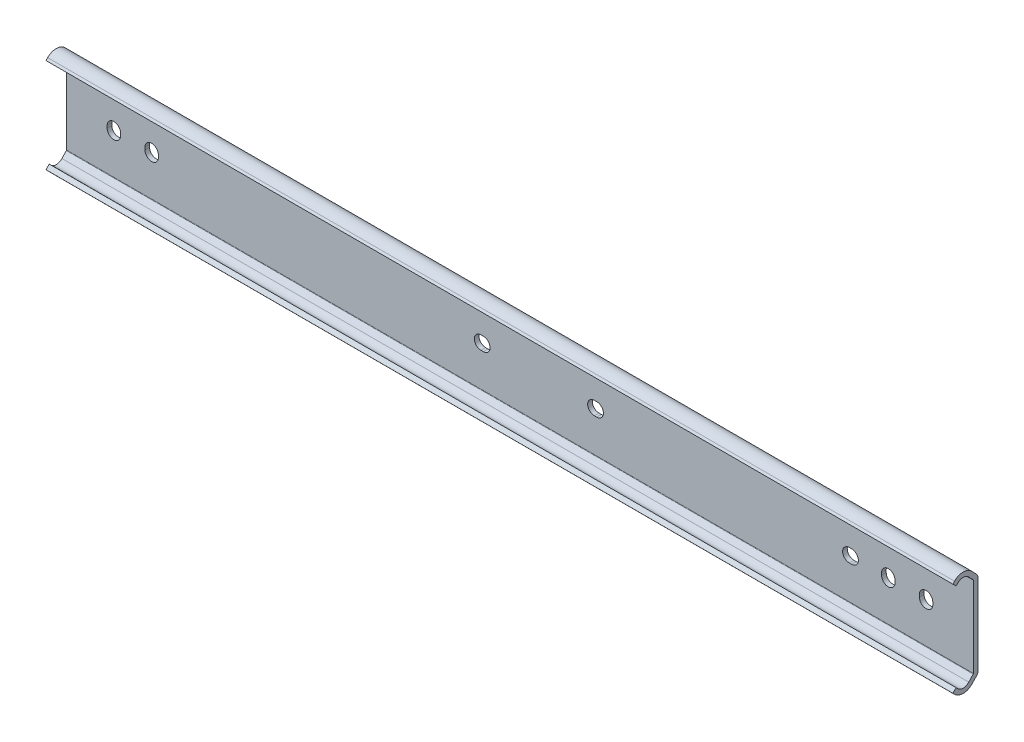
ISO-10303-21;
HEADER;
FILE_DESCRIPTION(('STEP AP214'),'2;1');
FILE_NAME('part.step','',(''),(''),'','','');
FILE_SCHEMA(('AUTOMOTIVE_DESIGN { 1 0 10303 214 1 1 1 1 }'));
ENDSEC;
DATA;
#1=APPLICATION_CONTEXT('core data for automotive mechanical design processes');
#2=APPLICATION_PROTOCOL_DEFINITION('international standard','automotive_design',2000,#1);
#3=PRODUCT_CONTEXT('',#1,'mechanical');
#4=PRODUCT('Part','Part','',(#3));
#5=PRODUCT_RELATED_PRODUCT_CATEGORY('part','',(#4));
#6=PRODUCT_DEFINITION_FORMATION('','',#4);
#7=PRODUCT_DEFINITION_CONTEXT('part definition',#1,'design');
#8=PRODUCT_DEFINITION('design','',#6,#7);
#9=PRODUCT_DEFINITION_SHAPE('','',#8);
#10=(LENGTH_UNIT() NAMED_UNIT(*) SI_UNIT(.MILLI.,.METRE.));
#11=(NAMED_UNIT(*) PLANE_ANGLE_UNIT() SI_UNIT($,.RADIAN.));
#12=(NAMED_UNIT(*) SI_UNIT($,.STERADIAN.) SOLID_ANGLE_UNIT());
#13=UNCERTAINTY_MEASURE_WITH_UNIT(LENGTH_MEASURE(1.E-05),#10,'distance_accuracy_value','');
#14=(GEOMETRIC_REPRESENTATION_CONTEXT(3) GLOBAL_UNCERTAINTY_ASSIGNED_CONTEXT((#13)) GLOBAL_UNIT_ASSIGNED_CONTEXT((#10,
#11,#12)) REPRESENTATION_CONTEXT('',''));
#15=CARTESIAN_POINT('',(0.,0.,0.));
#16=DIRECTION('',(0.,0.,1.));
#17=DIRECTION('',(1.,0.,0.));
#18=AXIS2_PLACEMENT_3D('',#15,#16,#17);
#19=CARTESIAN_POINT('',(288.9,13.5610179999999,1.54999923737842));
#20=DIRECTION('',(0.,0.,-1.));
#21=DIRECTION('',(1.,0.,0.));
#22=AXIS2_PLACEMENT_3D('',#19,#20,#21);
#23=PLANE('',#22);
#24=DIRECTION('',(-1.,0.,0.));
#25=VECTOR('',#24,1.);
#26=CARTESIAN_POINT('',(288.9,-13.5610179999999,1.54999923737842));
#27=LINE('',#26,#25);
#28=CARTESIAN_POINT('',(288.9,-13.5610179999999,1.54999923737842));
#29=VERTEX_POINT('',#28);
#30=CARTESIAN_POINT('',(-15.9,-13.5610179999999,1.54999923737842));
#31=VERTEX_POINT('',#30);
#32=EDGE_CURVE('E659',#29,#31,#27,.T.);
#33=ORIENTED_EDGE('',*,*,#32,.F.);
#34=DIRECTION('',(0.,-1.,0.));
#35=VECTOR('',#34,1.);
#36=CARTESIAN_POINT('',(288.9,13.5610179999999,1.54999923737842));
#37=LINE('',#36,#35);
#38=CARTESIAN_POINT('',(288.9,13.5610179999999,1.54999923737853));
#39=VERTEX_POINT('',#38);
#40=EDGE_CURVE('E607',#39,#29,#37,.T.);
#41=ORIENTED_EDGE('',*,*,#40,.F.);
#42=DIRECTION('',(-1.,0.,0.));
#43=VECTOR('',#42,1.);
#44=CARTESIAN_POINT('',(288.9,13.5610179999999,1.54999923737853));
#45=LINE('',#44,#43);
#46=CARTESIAN_POINT('',(-15.9,13.5610179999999,1.54999923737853));
#47=VERTEX_POINT('',#46);
#48=EDGE_CURVE('E662',#39,#47,#45,.T.);
#49=ORIENTED_EDGE('',*,*,#48,.T.);
#50=DIRECTION('',(0.,-1.,0.));
#51=VECTOR('',#50,1.);
#52=CARTESIAN_POINT('',(-15.9,13.5610179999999,1.54999923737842));
#53=LINE('',#52,#51);
#54=EDGE_CURVE('E566',#47,#31,#53,.T.);
#55=ORIENTED_EDGE('',*,*,#54,.T.);
#56=EDGE_LOOP('',(#33,#41,#49,#55));
#57=FACE_BOUND('',#56,.T.);
#58=DIRECTION('',(0.,1.,0.));
#59=VECTOR('',#58,1.);
#60=CARTESIAN_POINT('',(2.25,-0.4,1.54999923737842));
#61=LINE('',#60,#59);
#62=CARTESIAN_POINT('',(2.25,-0.4,1.54999923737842));
#63=VERTEX_POINT('',#62);
#64=CARTESIAN_POINT('',(2.25,0.4,1.54999923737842));
#65=VERTEX_POINT('',#64);
#66=EDGE_CURVE('E346',#63,#65,#61,.T.);
#67=ORIENTED_EDGE('',*,*,#66,.F.);
#68=CARTESIAN_POINT('',(0.,-0.4,1.54999923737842));
#69=DIRECTION('',(0.,0.,1.));
#70=DIRECTION('',(-1.,0.,0.));
#71=AXIS2_PLACEMENT_3D('',#68,#69,#70);
#72=CIRCLE('',#71,2.24999999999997);
#73=CARTESIAN_POINT('',(-2.25,-0.4,1.54999923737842));
#74=VERTEX_POINT('',#73);
#75=EDGE_CURVE('E29',#74,#63,#72,.T.);
#76=ORIENTED_EDGE('',*,*,#75,.F.);
#77=DIRECTION('',(0.,-1.,0.));
#78=VECTOR('',#77,1.);
#79=CARTESIAN_POINT('',(-2.25,-0.4,1.54999923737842));
#80=LINE('',#79,#78);
#81=CARTESIAN_POINT('',(-2.25,0.4,1.54999923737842));
#82=VERTEX_POINT('',#81);
#83=EDGE_CURVE('E337',#82,#74,#80,.T.);
#84=ORIENTED_EDGE('',*,*,#83,.F.);
#85=CARTESIAN_POINT('',(0.,0.4,1.54999923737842));
#86=DIRECTION('',(0.,0.,1.));
#87=DIRECTION('',(-1.,0.,0.));
#88=AXIS2_PLACEMENT_3D('',#85,#86,#87);
#89=CIRCLE('',#88,2.24999999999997);
#90=EDGE_CURVE('E340',#65,#82,#89,.T.);
#91=ORIENTED_EDGE('',*,*,#90,.F.);
#92=EDGE_LOOP('',(#67,#76,#84,#91));
#93=FACE_BOUND('',#92,.T.);
#94=DIRECTION('',(0.,1.,0.));
#95=VECTOR('',#94,1.);
#96=CARTESIAN_POINT('',(14.95,-0.4,1.54999923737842));
#97=LINE('',#96,#95);
#98=CARTESIAN_POINT('',(14.95,-0.4,1.54999923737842));
#99=VERTEX_POINT('',#98);
#100=CARTESIAN_POINT('',(14.95,0.4,1.54999923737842));
#101=VERTEX_POINT('',#100);
#102=EDGE_CURVE('E371',#99,#101,#97,.T.);
#103=ORIENTED_EDGE('',*,*,#102,.F.);
#104=CARTESIAN_POINT('',(12.7,-0.4,1.54999923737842));
#105=DIRECTION('',(0.,0.,1.));
#106=DIRECTION('',(-1.,0.,0.));
#107=AXIS2_PLACEMENT_3D('',#104,#105,#106);
#108=CIRCLE('',#107,2.24999999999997);
#109=CARTESIAN_POINT('',(10.45,-0.4,1.54999923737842));
#110=VERTEX_POINT('',#109);
#111=EDGE_CURVE('E352',#110,#99,#108,.T.);
#112=ORIENTED_EDGE('',*,*,#111,.F.);
#113=DIRECTION('',(0.,-1.,0.));
#114=VECTOR('',#113,1.);
#115=CARTESIAN_POINT('',(10.45,-0.4,1.54999923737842));
#116=LINE('',#115,#114);
#117=CARTESIAN_POINT('',(10.45,0.4,1.54999923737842));
#118=VERTEX_POINT('',#117);
#119=EDGE_CURVE('E360',#118,#110,#116,.T.);
#120=ORIENTED_EDGE('',*,*,#119,.F.);
#121=CARTESIAN_POINT('',(12.7,0.4,1.54999923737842));
#122=DIRECTION('',(0.,0.,1.));
#123=DIRECTION('',(-1.,0.,0.));
#124=AXIS2_PLACEMENT_3D('',#121,#122,#123);
#125=CIRCLE('',#124,2.24999999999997);
#126=EDGE_CURVE('E374',#101,#118,#125,.T.);
#127=ORIENTED_EDGE('',*,*,#126,.F.);
#128=EDGE_LOOP('',(#103,#112,#120,#127));
#129=FACE_BOUND('',#128,.T.);
#130=DIRECTION('',(-1.,0.,0.));
#131=VECTOR('',#130,1.);
#132=CARTESIAN_POINT('',(124.2,2.25000000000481,1.54999923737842));
#133=LINE('',#132,#131);
#134=CARTESIAN_POINT('',(124.2,2.25000000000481,1.54999923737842));
#135=VERTEX_POINT('',#134);
#136=CARTESIAN_POINT('',(123.4,2.25000000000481,1.54999923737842));
#137=VERTEX_POINT('',#136);
#138=EDGE_CURVE('E403',#135,#137,#133,.T.);
#139=ORIENTED_EDGE('',*,*,#138,.F.);
#140=CARTESIAN_POINT('',(124.2,0.,1.54999923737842));
#141=DIRECTION('',(0.,0.,1.));
#142=DIRECTION('',(-1.,0.,0.));
#143=AXIS2_PLACEMENT_3D('',#140,#141,#142);
#144=CIRCLE('',#143,2.25000000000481);
#145=CARTESIAN_POINT('',(124.2,-2.25000000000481,1.54999923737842));
#146=VERTEX_POINT('',#145);
#147=EDGE_CURVE('E381',#146,#135,#144,.T.);
#148=ORIENTED_EDGE('',*,*,#147,.F.);
#149=DIRECTION('',(1.,0.,0.));
#150=VECTOR('',#149,1.);
#151=CARTESIAN_POINT('',(124.2,-2.25000000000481,1.54999923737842));
#152=LINE('',#151,#150);
#153=CARTESIAN_POINT('',(123.4,-2.25000000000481,1.54999923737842));
#154=VERTEX_POINT('',#153);
#155=EDGE_CURVE('E392',#154,#146,#152,.T.);
#156=ORIENTED_EDGE('',*,*,#155,.F.);
#157=CARTESIAN_POINT('',(123.4,0.,1.54999923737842));
#158=DIRECTION('',(0.,0.,1.));
#159=DIRECTION('',(-1.,0.,0.));
#160=AXIS2_PLACEMENT_3D('',#157,#158,#159);
#161=CIRCLE('',#160,2.25000000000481);
#162=EDGE_CURVE('E406',#137,#154,#161,.T.);
#163=ORIENTED_EDGE('',*,*,#162,.F.);
#164=EDGE_LOOP('',(#139,#148,#156,#163));
#165=FACE_BOUND('',#164,.T.);
#166=DIRECTION('',(-1.,0.,0.));
#167=VECTOR('',#166,1.);
#168=CARTESIAN_POINT('',(162.3,2.25000000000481,1.54999923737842));
#169=LINE('',#168,#167);
#170=CARTESIAN_POINT('',(162.3,2.25000000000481,1.54999923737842));
#171=VERTEX_POINT('',#170);
#172=CARTESIAN_POINT('',(161.5,2.25000000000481,1.54999923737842));
#173=VERTEX_POINT('',#172);
#174=EDGE_CURVE('E435',#171,#173,#169,.T.);
#175=ORIENTED_EDGE('',*,*,#174,.F.);
#176=CARTESIAN_POINT('',(162.3,0.,1.54999923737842));
#177=DIRECTION('',(0.,0.,1.));
#178=DIRECTION('',(-1.,0.,0.));
#179=AXIS2_PLACEMENT_3D('',#176,#177,#178);
#180=CIRCLE('',#179,2.25000000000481);
#181=CARTESIAN_POINT('',(162.3,-2.25000000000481,1.54999923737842));
#182=VERTEX_POINT('',#181);
#183=EDGE_CURVE('E413',#182,#171,#180,.T.);
#184=ORIENTED_EDGE('',*,*,#183,.F.);
#185=DIRECTION('',(1.,0.,0.));
#186=VECTOR('',#185,1.);
#187=CARTESIAN_POINT('',(162.3,-2.25000000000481,1.54999923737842));
#188=LINE('',#187,#186);
#189=CARTESIAN_POINT('',(161.5,-2.25000000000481,1.54999923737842));
#190=VERTEX_POINT('',#189);
#191=EDGE_CURVE('E424',#190,#182,#188,.T.);
#192=ORIENTED_EDGE('',*,*,#191,.F.);
#193=CARTESIAN_POINT('',(161.5,0.,1.54999923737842));
#194=DIRECTION('',(0.,0.,1.));
#195=DIRECTION('',(-1.,0.,0.));
#196=AXIS2_PLACEMENT_3D('',#193,#194,#195);
#197=CIRCLE('',#196,2.25000000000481);
#198=EDGE_CURVE('E438',#173,#190,#197,.T.);
#199=ORIENTED_EDGE('',*,*,#198,.F.);
#200=EDGE_LOOP('',(#175,#184,#192,#199));
#201=FACE_BOUND('',#200,.T.);
#202=DIRECTION('',(0.,1.,0.));
#203=VECTOR('',#202,1.);
#204=CARTESIAN_POINT('',(262.55,-0.4,1.54999923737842));
#205=LINE('',#204,#203);
#206=CARTESIAN_POINT('',(262.55,-0.4,1.54999923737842));
#207=VERTEX_POINT('',#206);
#208=CARTESIAN_POINT('',(262.55,0.4,1.54999923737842));
#209=VERTEX_POINT('',#208);
#210=EDGE_CURVE('E467',#207,#209,#205,.T.);
#211=ORIENTED_EDGE('',*,*,#210,.F.);
#212=CARTESIAN_POINT('',(260.3,-0.4,1.54999923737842));
#213=DIRECTION('',(0.,0.,1.));
#214=DIRECTION('',(-1.,0.,0.));
#215=AXIS2_PLACEMENT_3D('',#212,#213,#214);
#216=CIRCLE('',#215,2.24999999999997);
#217=CARTESIAN_POINT('',(258.05,-0.4,1.54999923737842));
#218=VERTEX_POINT('',#217);
#219=EDGE_CURVE('E445',#218,#207,#216,.T.);
#220=ORIENTED_EDGE('',*,*,#219,.F.);
#221=DIRECTION('',(0.,-1.,0.));
#222=VECTOR('',#221,1.);
#223=CARTESIAN_POINT('',(258.05,-0.4,1.54999923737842));
#224=LINE('',#223,#222);
#225=CARTESIAN_POINT('',(258.05,0.4,1.54999923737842));
#226=VERTEX_POINT('',#225);
#227=EDGE_CURVE('E456',#226,#218,#224,.T.);
#228=ORIENTED_EDGE('',*,*,#227,.F.);
#229=CARTESIAN_POINT('',(260.3,0.4,1.54999923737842));
#230=DIRECTION('',(0.,0.,1.));
#231=DIRECTION('',(-1.,0.,0.));
#232=AXIS2_PLACEMENT_3D('',#229,#230,#231);
#233=CIRCLE('',#232,2.24999999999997);
#234=EDGE_CURVE('E470',#209,#226,#233,.T.);
#235=ORIENTED_EDGE('',*,*,#234,.F.);
#236=EDGE_LOOP('',(#211,#220,#228,#235));
#237=FACE_BOUND('',#236,.T.);
#238=DIRECTION('',(-1.,0.,0.));
#239=VECTOR('',#238,1.);
#240=CARTESIAN_POINT('',(248.,2.25000000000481,1.54999923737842));
#241=LINE('',#240,#239);
#242=CARTESIAN_POINT('',(248.,2.25000000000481,1.54999923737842));
#243=VERTEX_POINT('',#242);
#244=CARTESIAN_POINT('',(247.2,2.25000000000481,1.54999923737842));
#245=VERTEX_POINT('',#244);
#246=EDGE_CURVE('E499',#243,#245,#241,.T.);
#247=ORIENTED_EDGE('',*,*,#246,.F.);
#248=CARTESIAN_POINT('',(248.,0.,1.54999923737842));
#249=DIRECTION('',(0.,0.,1.));
#250=DIRECTION('',(-1.,0.,0.));
#251=AXIS2_PLACEMENT_3D('',#248,#249,#250);
#252=CIRCLE('',#251,2.25000000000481);
#253=CARTESIAN_POINT('',(248.,-2.25000000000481,1.54999923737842));
#254=VERTEX_POINT('',#253);
#255=EDGE_CURVE('E477',#254,#243,#252,.T.);
#256=ORIENTED_EDGE('',*,*,#255,.F.);
#257=DIRECTION('',(1.,0.,0.));
#258=VECTOR('',#257,1.);
#259=CARTESIAN_POINT('',(248.,-2.25000000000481,1.54999923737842));
#260=LINE('',#259,#258);
#261=CARTESIAN_POINT('',(247.2,-2.25000000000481,1.54999923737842));
#262=VERTEX_POINT('',#261);
#263=EDGE_CURVE('E488',#262,#254,#260,.T.);
#264=ORIENTED_EDGE('',*,*,#263,.F.);
#265=CARTESIAN_POINT('',(247.2,0.,1.54999923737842));
#266=DIRECTION('',(0.,0.,1.));
#267=DIRECTION('',(-1.,0.,0.));
#268=AXIS2_PLACEMENT_3D('',#265,#266,#267);
#269=CIRCLE('',#268,2.25000000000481);
#270=EDGE_CURVE('E502',#245,#262,#269,.T.);
#271=ORIENTED_EDGE('',*,*,#270,.F.);
#272=EDGE_LOOP('',(#247,#256,#264,#271));
#273=FACE_BOUND('',#272,.T.);
#274=DIRECTION('',(0.,1.,0.));
#275=VECTOR('',#274,1.);
#276=CARTESIAN_POINT('',(275.25,-0.4,1.54999923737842));
#277=LINE('',#276,#275);
#278=CARTESIAN_POINT('',(275.25,-0.4,1.54999923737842));
#279=VERTEX_POINT('',#278);
#280=CARTESIAN_POINT('',(275.25,0.4,1.54999923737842));
#281=VERTEX_POINT('',#280);
#282=EDGE_CURVE('E531',#279,#281,#277,.T.);
#283=ORIENTED_EDGE('',*,*,#282,.F.);
#284=CARTESIAN_POINT('',(273.,-0.4,1.54999923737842));
#285=DIRECTION('',(0.,0.,1.));
#286=DIRECTION('',(-1.,0.,0.));
#287=AXIS2_PLACEMENT_3D('',#284,#285,#286);
#288=CIRCLE('',#287,2.24999999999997);
#289=CARTESIAN_POINT('',(270.75,-0.4,1.54999923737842));
#290=VERTEX_POINT('',#289);
#291=EDGE_CURVE('E509',#290,#279,#288,.T.);
#292=ORIENTED_EDGE('',*,*,#291,.F.);
#293=DIRECTION('',(0.,-1.,0.));
#294=VECTOR('',#293,1.);
#295=CARTESIAN_POINT('',(270.75,-0.4,1.54999923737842));
#296=LINE('',#295,#294);
#297=CARTESIAN_POINT('',(270.75,0.4,1.54999923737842));
#298=VERTEX_POINT('',#297);
#299=EDGE_CURVE('E520',#298,#290,#296,.T.);
#300=ORIENTED_EDGE('',*,*,#299,.F.);
#301=CARTESIAN_POINT('',(273.,0.4,1.54999923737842));
#302=DIRECTION('',(0.,0.,1.));
#303=DIRECTION('',(-1.,0.,0.));
#304=AXIS2_PLACEMENT_3D('',#301,#302,#303);
#305=CIRCLE('',#304,2.24999999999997);
#306=EDGE_CURVE('E534',#281,#298,#305,.T.);
#307=ORIENTED_EDGE('',*,*,#306,.F.);
#308=EDGE_LOOP('',(#283,#292,#300,#307));
#309=FACE_BOUND('',#308,.T.);
#310=ADVANCED_FACE('F14',(#57,#93,#129,#165,#201,#237,#273,#309),#23,.F.);
#311=CARTESIAN_POINT('',(288.9,13.5610176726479,0.));
#312=DIRECTION('',(0.,0.,1.));
#313=DIRECTION('',(-1.,0.,0.));
#314=AXIS2_PLACEMENT_3D('',#311,#312,#313);
#315=PLANE('',#314);
#316=DIRECTION('',(0.,-1.,0.));
#317=VECTOR('',#316,1.);
#318=CARTESIAN_POINT('',(-2.25,-0.4,0.));
#319=LINE('',#318,#317);
#320=CARTESIAN_POINT('',(-2.25,0.4,0.));
#321=VERTEX_POINT('',#320);
#322=CARTESIAN_POINT('',(-2.25,-0.4,0.));
#323=VERTEX_POINT('',#322);
#324=EDGE_CURVE('E327',#321,#323,#319,.T.);
#325=ORIENTED_EDGE('',*,*,#324,.T.);
#326=CARTESIAN_POINT('',(0.,-0.4,0.));
#327=DIRECTION('',(0.,0.,1.));
#328=DIRECTION('',(-1.,0.,0.));
#329=AXIS2_PLACEMENT_3D('',#326,#327,#328);
#330=CIRCLE('',#329,2.24999999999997);
#331=CARTESIAN_POINT('',(2.25,-0.4,0.));
#332=VERTEX_POINT('',#331);
#333=EDGE_CURVE('E321',#323,#332,#330,.T.);
#334=ORIENTED_EDGE('',*,*,#333,.T.);
#335=DIRECTION('',(0.,1.,0.));
#336=VECTOR('',#335,1.);
#337=CARTESIAN_POINT('',(2.25,-0.4,0.));
#338=LINE('',#337,#336);
#339=CARTESIAN_POINT('',(2.25,0.4,0.));
#340=VERTEX_POINT('',#339);
#341=EDGE_CURVE('E330',#332,#340,#338,.T.);
#342=ORIENTED_EDGE('',*,*,#341,.T.);
#343=CARTESIAN_POINT('',(0.,0.4,0.));
#344=DIRECTION('',(0.,0.,1.));
#345=DIRECTION('',(-1.,0.,0.));
#346=AXIS2_PLACEMENT_3D('',#343,#344,#345);
#347=CIRCLE('',#346,2.24999999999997);
#348=EDGE_CURVE('E37',#340,#321,#347,.T.);
#349=ORIENTED_EDGE('',*,*,#348,.T.);
#350=EDGE_LOOP('',(#325,#334,#342,#349));
#351=FACE_BOUND('',#350,.T.);
#352=DIRECTION('',(0.,-1.,0.));
#353=VECTOR('',#352,1.);
#354=CARTESIAN_POINT('',(10.45,-0.4,0.));
#355=LINE('',#354,#353);
#356=CARTESIAN_POINT('',(10.45,0.4,0.));
#357=VERTEX_POINT('',#356);
#358=CARTESIAN_POINT('',(10.45,-0.4,0.));
#359=VERTEX_POINT('',#358);
#360=EDGE_CURVE('E366',#357,#359,#355,.T.);
#361=ORIENTED_EDGE('',*,*,#360,.T.);
#362=CARTESIAN_POINT('',(12.7,-0.4,0.));
#363=DIRECTION('',(0.,0.,1.));
#364=DIRECTION('',(-1.,0.,0.));
#365=AXIS2_PLACEMENT_3D('',#362,#363,#364);
#366=CIRCLE('',#365,2.24999999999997);
#367=CARTESIAN_POINT('',(14.95,-0.4,0.));
#368=VERTEX_POINT('',#367);
#369=EDGE_CURVE('E356',#359,#368,#366,.T.);
#370=ORIENTED_EDGE('',*,*,#369,.T.);
#371=DIRECTION('',(0.,1.,0.));
#372=VECTOR('',#371,1.);
#373=CARTESIAN_POINT('',(14.95,-0.4,0.));
#374=LINE('',#373,#372);
#375=CARTESIAN_POINT('',(14.95,0.4,0.));
#376=VERTEX_POINT('',#375);
#377=EDGE_CURVE('E359',#368,#376,#374,.T.);
#378=ORIENTED_EDGE('',*,*,#377,.T.);
#379=CARTESIAN_POINT('',(12.7,0.4,0.));
#380=DIRECTION('',(0.,0.,1.));
#381=DIRECTION('',(-1.,0.,0.));
#382=AXIS2_PLACEMENT_3D('',#379,#380,#381);
#383=CIRCLE('',#382,2.24999999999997);
#384=EDGE_CURVE('E363',#376,#357,#383,.T.);
#385=ORIENTED_EDGE('',*,*,#384,.T.);
#386=EDGE_LOOP('',(#361,#370,#378,#385));
#387=FACE_BOUND('',#386,.T.);
#388=DIRECTION('',(1.,0.,0.));
#389=VECTOR('',#388,1.);
#390=CARTESIAN_POINT('',(124.2,-2.25000000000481,0.));
#391=LINE('',#390,#389);
#392=CARTESIAN_POINT('',(123.4,-2.25000000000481,0.));
#393=VERTEX_POINT('',#392);
#394=CARTESIAN_POINT('',(124.2,-2.25000000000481,0.));
#395=VERTEX_POINT('',#394);
#396=EDGE_CURVE('E398',#393,#395,#391,.T.);
#397=ORIENTED_EDGE('',*,*,#396,.T.);
#398=CARTESIAN_POINT('',(124.2,0.,0.));
#399=DIRECTION('',(0.,0.,1.));
#400=DIRECTION('',(-1.,0.,0.));
#401=AXIS2_PLACEMENT_3D('',#398,#399,#400);
#402=CIRCLE('',#401,2.25000000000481);
#403=CARTESIAN_POINT('',(124.2,2.25000000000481,0.));
#404=VERTEX_POINT('',#403);
#405=EDGE_CURVE('E388',#395,#404,#402,.T.);
#406=ORIENTED_EDGE('',*,*,#405,.T.);
#407=DIRECTION('',(-1.,0.,0.));
#408=VECTOR('',#407,1.);
#409=CARTESIAN_POINT('',(124.2,2.25000000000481,0.));
#410=LINE('',#409,#408);
#411=CARTESIAN_POINT('',(123.4,2.25000000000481,0.));
#412=VERTEX_POINT('',#411);
#413=EDGE_CURVE('E391',#404,#412,#410,.T.);
#414=ORIENTED_EDGE('',*,*,#413,.T.);
#415=CARTESIAN_POINT('',(123.4,0.,0.));
#416=DIRECTION('',(0.,0.,1.));
#417=DIRECTION('',(-1.,0.,0.));
#418=AXIS2_PLACEMENT_3D('',#415,#416,#417);
#419=CIRCLE('',#418,2.25000000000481);
#420=EDGE_CURVE('E395',#412,#393,#419,.T.);
#421=ORIENTED_EDGE('',*,*,#420,.T.);
#422=EDGE_LOOP('',(#397,#406,#414,#421));
#423=FACE_BOUND('',#422,.T.);
#424=DIRECTION('',(1.,0.,0.));
#425=VECTOR('',#424,1.);
#426=CARTESIAN_POINT('',(162.3,-2.25000000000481,0.));
#427=LINE('',#426,#425);
#428=CARTESIAN_POINT('',(161.5,-2.25000000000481,0.));
#429=VERTEX_POINT('',#428);
#430=CARTESIAN_POINT('',(162.3,-2.25000000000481,0.));
#431=VERTEX_POINT('',#430);
#432=EDGE_CURVE('E430',#429,#431,#427,.T.);
#433=ORIENTED_EDGE('',*,*,#432,.T.);
#434=CARTESIAN_POINT('',(162.3,0.,0.));
#435=DIRECTION('',(0.,0.,1.));
#436=DIRECTION('',(-1.,0.,0.));
#437=AXIS2_PLACEMENT_3D('',#434,#435,#436);
#438=CIRCLE('',#437,2.25000000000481);
#439=CARTESIAN_POINT('',(162.3,2.25000000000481,0.));
#440=VERTEX_POINT('',#439);
#441=EDGE_CURVE('E420',#431,#440,#438,.T.);
#442=ORIENTED_EDGE('',*,*,#441,.T.);
#443=DIRECTION('',(-1.,0.,0.));
#444=VECTOR('',#443,1.);
#445=CARTESIAN_POINT('',(162.3,2.25000000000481,0.));
#446=LINE('',#445,#444);
#447=CARTESIAN_POINT('',(161.5,2.25000000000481,0.));
#448=VERTEX_POINT('',#447);
#449=EDGE_CURVE('E423',#440,#448,#446,.T.);
#450=ORIENTED_EDGE('',*,*,#449,.T.);
#451=CARTESIAN_POINT('',(161.5,0.,0.));
#452=DIRECTION('',(0.,0.,1.));
#453=DIRECTION('',(-1.,0.,0.));
#454=AXIS2_PLACEMENT_3D('',#451,#452,#453);
#455=CIRCLE('',#454,2.25000000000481);
#456=EDGE_CURVE('E427',#448,#429,#455,.T.);
#457=ORIENTED_EDGE('',*,*,#456,.T.);
#458=EDGE_LOOP('',(#433,#442,#450,#457));
#459=FACE_BOUND('',#458,.T.);
#460=DIRECTION('',(0.,-1.,0.));
#461=VECTOR('',#460,1.);
#462=CARTESIAN_POINT('',(258.05,-0.4,0.));
#463=LINE('',#462,#461);
#464=CARTESIAN_POINT('',(258.05,0.4,0.));
#465=VERTEX_POINT('',#464);
#466=CARTESIAN_POINT('',(258.05,-0.4,0.));
#467=VERTEX_POINT('',#466);
#468=EDGE_CURVE('E462',#465,#467,#463,.T.);
#469=ORIENTED_EDGE('',*,*,#468,.T.);
#470=CARTESIAN_POINT('',(260.3,-0.4,0.));
#471=DIRECTION('',(0.,0.,1.));
#472=DIRECTION('',(-1.,0.,0.));
#473=AXIS2_PLACEMENT_3D('',#470,#471,#472);
#474=CIRCLE('',#473,2.24999999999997);
#475=CARTESIAN_POINT('',(262.55,-0.4,0.));
#476=VERTEX_POINT('',#475);
#477=EDGE_CURVE('E452',#467,#476,#474,.T.);
#478=ORIENTED_EDGE('',*,*,#477,.T.);
#479=DIRECTION('',(0.,1.,0.));
#480=VECTOR('',#479,1.);
#481=CARTESIAN_POINT('',(262.55,-0.4,0.));
#482=LINE('',#481,#480);
#483=CARTESIAN_POINT('',(262.55,0.4,0.));
#484=VERTEX_POINT('',#483);
#485=EDGE_CURVE('E455',#476,#484,#482,.T.);
#486=ORIENTED_EDGE('',*,*,#485,.T.);
#487=CARTESIAN_POINT('',(260.3,0.4,0.));
#488=DIRECTION('',(0.,0.,1.));
#489=DIRECTION('',(-1.,0.,0.));
#490=AXIS2_PLACEMENT_3D('',#487,#488,#489);
#491=CIRCLE('',#490,2.24999999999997);
#492=EDGE_CURVE('E459',#484,#465,#491,.T.);
#493=ORIENTED_EDGE('',*,*,#492,.T.);
#494=EDGE_LOOP('',(#469,#478,#486,#493));
#495=FACE_BOUND('',#494,.T.);
#496=DIRECTION('',(1.,0.,0.));
#497=VECTOR('',#496,1.);
#498=CARTESIAN_POINT('',(248.,-2.25000000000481,0.));
#499=LINE('',#498,#497);
#500=CARTESIAN_POINT('',(247.2,-2.25000000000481,0.));
#501=VERTEX_POINT('',#500);
#502=CARTESIAN_POINT('',(248.,-2.25000000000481,0.));
#503=VERTEX_POINT('',#502);
#504=EDGE_CURVE('E494',#501,#503,#499,.T.);
#505=ORIENTED_EDGE('',*,*,#504,.T.);
#506=CARTESIAN_POINT('',(248.,0.,0.));
#507=DIRECTION('',(0.,0.,1.));
#508=DIRECTION('',(-1.,0.,0.));
#509=AXIS2_PLACEMENT_3D('',#506,#507,#508);
#510=CIRCLE('',#509,2.25000000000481);
#511=CARTESIAN_POINT('',(248.,2.25000000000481,0.));
#512=VERTEX_POINT('',#511);
#513=EDGE_CURVE('E484',#503,#512,#510,.T.);
#514=ORIENTED_EDGE('',*,*,#513,.T.);
#515=DIRECTION('',(-1.,0.,0.));
#516=VECTOR('',#515,1.);
#517=CARTESIAN_POINT('',(248.,2.25000000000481,0.));
#518=LINE('',#517,#516);
#519=CARTESIAN_POINT('',(247.2,2.25000000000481,0.));
#520=VERTEX_POINT('',#519);
#521=EDGE_CURVE('E487',#512,#520,#518,.T.);
#522=ORIENTED_EDGE('',*,*,#521,.T.);
#523=CARTESIAN_POINT('',(247.2,0.,0.));
#524=DIRECTION('',(0.,0.,1.));
#525=DIRECTION('',(-1.,0.,0.));
#526=AXIS2_PLACEMENT_3D('',#523,#524,#525);
#527=CIRCLE('',#526,2.25000000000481);
#528=EDGE_CURVE('E491',#520,#501,#527,.T.);
#529=ORIENTED_EDGE('',*,*,#528,.T.);
#530=EDGE_LOOP('',(#505,#514,#522,#529));
#531=FACE_BOUND('',#530,.T.);
#532=DIRECTION('',(0.,-1.,0.));
#533=VECTOR('',#532,1.);
#534=CARTESIAN_POINT('',(270.75,-0.4,0.));
#535=LINE('',#534,#533);
#536=CARTESIAN_POINT('',(270.75,0.4,0.));
#537=VERTEX_POINT('',#536);
#538=CARTESIAN_POINT('',(270.75,-0.4,0.));
#539=VERTEX_POINT('',#538);
#540=EDGE_CURVE('E526',#537,#539,#535,.T.);
#541=ORIENTED_EDGE('',*,*,#540,.T.);
#542=CARTESIAN_POINT('',(273.,-0.4,0.));
#543=DIRECTION('',(0.,0.,1.));
#544=DIRECTION('',(-1.,0.,0.));
#545=AXIS2_PLACEMENT_3D('',#542,#543,#544);
#546=CIRCLE('',#545,2.24999999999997);
#547=CARTESIAN_POINT('',(275.25,-0.4,0.));
#548=VERTEX_POINT('',#547);
#549=EDGE_CURVE('E516',#539,#548,#546,.T.);
#550=ORIENTED_EDGE('',*,*,#549,.T.);
#551=DIRECTION('',(0.,1.,0.));
#552=VECTOR('',#551,1.);
#553=CARTESIAN_POINT('',(275.25,-0.4,0.));
#554=LINE('',#553,#552);
#555=CARTESIAN_POINT('',(275.25,0.4,0.));
#556=VERTEX_POINT('',#555);
#557=EDGE_CURVE('E519',#548,#556,#554,.T.);
#558=ORIENTED_EDGE('',*,*,#557,.T.);
#559=CARTESIAN_POINT('',(273.,0.4,0.));
#560=DIRECTION('',(0.,0.,1.));
#561=DIRECTION('',(-1.,0.,0.));
#562=AXIS2_PLACEMENT_3D('',#559,#560,#561);
#563=CIRCLE('',#562,2.24999999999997);
#564=EDGE_CURVE('E523',#556,#537,#563,.T.);
#565=ORIENTED_EDGE('',*,*,#564,.T.);
#566=EDGE_LOOP('',(#541,#550,#558,#565));
#567=FACE_BOUND('',#566,.T.);
#568=DIRECTION('',(-1.,0.,0.));
#569=VECTOR('',#568,1.);
#570=CARTESIAN_POINT('',(288.9,13.5610176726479,0.));
#571=LINE('',#570,#569);
#572=CARTESIAN_POINT('',(288.9,13.5610176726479,0.));
#573=VERTEX_POINT('',#572);
#574=CARTESIAN_POINT('',(-15.9,13.5610176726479,0.));
#575=VERTEX_POINT('',#574);
#576=EDGE_CURVE('E629',#573,#575,#571,.T.);
#577=ORIENTED_EDGE('',*,*,#576,.F.);
#578=DIRECTION('',(0.,1.,0.));
#579=VECTOR('',#578,1.);
#580=CARTESIAN_POINT('',(288.9,13.5610176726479,0.));
#581=LINE('',#580,#579);
#582=CARTESIAN_POINT('',(288.9,-13.5610176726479,0.));
#583=VERTEX_POINT('',#582);
#584=EDGE_CURVE('E627',#583,#573,#581,.T.);
#585=ORIENTED_EDGE('',*,*,#584,.F.);
#586=DIRECTION('',(-1.,0.,0.));
#587=VECTOR('',#586,1.);
#588=CARTESIAN_POINT('',(288.9,-13.5610176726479,0.));
#589=LINE('',#588,#587);
#590=CARTESIAN_POINT('',(-15.9,-13.5610176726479,0.));
#591=VERTEX_POINT('',#590);
#592=EDGE_CURVE('E632',#583,#591,#589,.T.);
#593=ORIENTED_EDGE('',*,*,#592,.T.);
#594=DIRECTION('',(0.,1.,0.));
#595=VECTOR('',#594,1.);
#596=CARTESIAN_POINT('',(-15.9,13.5610176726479,0.));
#597=LINE('',#596,#595);
#598=EDGE_CURVE('E586',#591,#575,#597,.T.);
#599=ORIENTED_EDGE('',*,*,#598,.T.);
#600=EDGE_LOOP('',(#577,#585,#593,#599));
#601=FACE_BOUND('',#600,.T.);
#602=ADVANCED_FACE('F334',(#351,#387,#423,#459,#495,#531,#567,#601),#315,.F.);
#603=CARTESIAN_POINT('',(288.9,13.5610175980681,1.80000204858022));
#604=DIRECTION('',(-1.,0.,0.));
#605=DIRECTION('',(0.,0.,-1.));
#606=AXIS2_PLACEMENT_3D('',#603,#604,#605);
#607=PLANE('',#606);
#608=ORIENTED_EDGE('',*,*,#584,.T.);
#609=CARTESIAN_POINT('',(288.9,13.5610175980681,1.80000204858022));
#610=DIRECTION('',(1.,0.,0.));
#611=DIRECTION('',(0.,0.,-1.));
#612=AXIS2_PLACEMENT_3D('',#609,#610,#611);
#613=CIRCLE('',#612,1.80000204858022);
#614=CARTESIAN_POINT('',(288.9,14.8073560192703,0.501291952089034));
#615=VERTEX_POINT('',#614);
#616=EDGE_CURVE('E588',#573,#615,#613,.T.);
#617=ORIENTED_EDGE('',*,*,#616,.T.);
#618=DIRECTION('',(0.,0.721504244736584,0.692410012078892));
#619=VECTOR('',#618,1.);
#620=CARTESIAN_POINT('',(288.9,14.8073560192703,0.501291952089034));
#621=LINE('',#620,#619);
#622=CARTESIAN_POINT('',(288.9,16.4741380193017,2.10086195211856));
#623=VERTEX_POINT('',#622);
#624=EDGE_CURVE('E591',#615,#623,#621,.T.);
#625=ORIENTED_EDGE('',*,*,#624,.T.);
#626=CARTESIAN_POINT('',(288.9,13.5750002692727,4.99999970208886));
#627=DIRECTION('',(1.,0.,0.));
#628=DIRECTION('',(0.,0.,-1.));
#629=AXIS2_PLACEMENT_3D('',#626,#627,#628);
#630=CIRCLE('',#629,4.09999992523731);
#631=CARTESIAN_POINT('',(288.9,16.4741385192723,7.89913695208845));
#632=VERTEX_POINT('',#631);
#633=EDGE_CURVE('E593',#623,#632,#630,.T.);
#634=ORIENTED_EDGE('',*,*,#633,.T.);
#635=DIRECTION('',(0.,-0.721503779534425,0.692410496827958));
#636=VECTOR('',#635,1.);
#637=CARTESIAN_POINT('',(288.9,16.4741385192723,7.89913695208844));
#638=LINE('',#637,#636);
#639=CARTESIAN_POINT('',(288.9,15.8897095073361,8.45999996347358));
#640=VERTEX_POINT('',#639);
#641=EDGE_CURVE('E595',#632,#640,#638,.T.);
#642=ORIENTED_EDGE('',*,*,#641,.T.);
#643=DIRECTION('',(0.,-0.707106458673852,-0.707107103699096));
#644=VECTOR('',#643,1.);
#645=CARTESIAN_POINT('',(288.9,14.7934625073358,7.36375196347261));
#646=LINE('',#645,#644);
#647=CARTESIAN_POINT('',(288.9,14.7934625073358,7.36375196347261));
#648=VERTEX_POINT('',#647);
#649=EDGE_CURVE('E597',#640,#648,#646,.T.);
#650=ORIENTED_EDGE('',*,*,#649,.T.);
#651=DIRECTION('',(0.,0.721504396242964,-0.692409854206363));
#652=VECTOR('',#651,1.);
#653=CARTESIAN_POINT('',(288.9,15.2920597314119,6.88526058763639));
#654=LINE('',#653,#652);
#655=CARTESIAN_POINT('',(288.9,15.2920597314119,6.88526058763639));
#656=VERTEX_POINT('',#655);
#657=EDGE_CURVE('E599',#648,#656,#654,.T.);
#658=ORIENTED_EDGE('',*,*,#657,.T.);
#659=CARTESIAN_POINT('',(288.9,13.5750002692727,4.99999970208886));
#660=DIRECTION('',(-1.,0.,0.));
#661=DIRECTION('',(0.,0.,1.));
#662=AXIS2_PLACEMENT_3D('',#659,#660,#661);
#663=CIRCLE('',#662,2.55000035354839);
#664=CARTESIAN_POINT('',(288.9,15.2920521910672,3.11473194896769));
#665=VERTEX_POINT('',#664);
#666=EDGE_CURVE('E601',#656,#665,#663,.T.);
#667=ORIENTED_EDGE('',*,*,#666,.T.);
#668=DIRECTION('',(0.,-0.72150413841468,-0.692410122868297));
#669=VECTOR('',#668,1.);
#670=CARTESIAN_POINT('',(288.9,13.7341215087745,1.61962344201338));
#671=LINE('',#670,#669);
#672=CARTESIAN_POINT('',(288.9,13.7341215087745,1.61962344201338));
#673=VERTEX_POINT('',#672);
#674=EDGE_CURVE('E603',#665,#673,#671,.T.);
#675=ORIENTED_EDGE('',*,*,#674,.T.);
#676=CARTESIAN_POINT('',(288.9,13.5610175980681,1.80000204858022));
#677=DIRECTION('',(-1.,0.,0.));
#678=DIRECTION('',(0.,0.,1.));
#679=AXIS2_PLACEMENT_3D('',#676,#677,#678);
#680=CIRCLE('',#679,0.250002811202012);
#681=EDGE_CURVE('E605',#673,#39,#680,.T.);
#682=ORIENTED_EDGE('',*,*,#681,.T.);
#683=ORIENTED_EDGE('',*,*,#40,.T.);
#684=CARTESIAN_POINT('',(288.9,-13.5610175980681,1.80000204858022));
#685=DIRECTION('',(-1.,0.,0.));
#686=DIRECTION('',(0.,0.,-1.));
#687=AXIS2_PLACEMENT_3D('',#684,#685,#686);
#688=CIRCLE('',#687,0.250002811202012);
#689=CARTESIAN_POINT('',(288.9,-13.7341215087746,1.6196234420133));
#690=VERTEX_POINT('',#689);
#691=EDGE_CURVE('E609',#29,#690,#688,.T.);
#692=ORIENTED_EDGE('',*,*,#691,.T.);
#693=DIRECTION('',(0.,-0.72150413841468,0.692410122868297));
#694=VECTOR('',#693,1.);
#695=CARTESIAN_POINT('',(288.9,-13.7341215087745,1.61962344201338));
#696=LINE('',#695,#694);
#697=CARTESIAN_POINT('',(288.9,-15.2920521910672,3.11473194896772));
#698=VERTEX_POINT('',#697);
#699=EDGE_CURVE('E611',#690,#698,#696,.T.);
#700=ORIENTED_EDGE('',*,*,#699,.T.);
#701=CARTESIAN_POINT('',(288.9,-13.5750002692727,4.99999970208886));
#702=DIRECTION('',(-1.,0.,0.));
#703=DIRECTION('',(0.,0.,-1.));
#704=AXIS2_PLACEMENT_3D('',#701,#702,#703);
#705=CIRCLE('',#704,2.55000035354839);
#706=CARTESIAN_POINT('',(288.9,-15.2920597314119,6.88526058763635));
#707=VERTEX_POINT('',#706);
#708=EDGE_CURVE('E613',#698,#707,#705,.T.);
#709=ORIENTED_EDGE('',*,*,#708,.T.);
#710=DIRECTION('',(0.,0.721504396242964,0.692409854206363));
#711=VECTOR('',#710,1.);
#712=CARTESIAN_POINT('',(288.9,-15.2920597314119,6.88526058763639));
#713=LINE('',#712,#711);
#714=CARTESIAN_POINT('',(288.9,-14.7934625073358,7.36375196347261));
#715=VERTEX_POINT('',#714);
#716=EDGE_CURVE('E615',#707,#715,#713,.T.);
#717=ORIENTED_EDGE('',*,*,#716,.T.);
#718=DIRECTION('',(0.,-0.707106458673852,0.707107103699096));
#719=VECTOR('',#718,1.);
#720=CARTESIAN_POINT('',(288.9,-14.7934625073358,7.36375196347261));
#721=LINE('',#720,#719);
#722=CARTESIAN_POINT('',(288.9,-15.8897095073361,8.45999996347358));
#723=VERTEX_POINT('',#722);
#724=EDGE_CURVE('E617',#715,#723,#721,.T.);
#725=ORIENTED_EDGE('',*,*,#724,.T.);
#726=DIRECTION('',(0.,-0.721503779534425,-0.692410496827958));
#727=VECTOR('',#726,1.);
#728=CARTESIAN_POINT('',(288.9,-16.4741385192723,7.89913695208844));
#729=LINE('',#728,#727);
#730=CARTESIAN_POINT('',(288.9,-16.4741385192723,7.89913695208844));
#731=VERTEX_POINT('',#730);
#732=EDGE_CURVE('E619',#723,#731,#729,.T.);
#733=ORIENTED_EDGE('',*,*,#732,.T.);
#734=CARTESIAN_POINT('',(288.9,-13.5750002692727,4.99999970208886));
#735=DIRECTION('',(1.,0.,0.));
#736=DIRECTION('',(0.,0.,1.));
#737=AXIS2_PLACEMENT_3D('',#734,#735,#736);
#738=CIRCLE('',#737,4.09999992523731);
#739=CARTESIAN_POINT('',(288.9,-16.4741380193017,2.10086195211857));
#740=VERTEX_POINT('',#739);
#741=EDGE_CURVE('E621',#731,#740,#738,.T.);
#742=ORIENTED_EDGE('',*,*,#741,.T.);
#743=DIRECTION('',(0.,0.721504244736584,-0.692410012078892));
#744=VECTOR('',#743,1.);
#745=CARTESIAN_POINT('',(288.9,-14.8073560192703,0.501291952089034));
#746=LINE('',#745,#744);
#747=CARTESIAN_POINT('',(288.9,-14.8073560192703,0.501291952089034));
#748=VERTEX_POINT('',#747);
#749=EDGE_CURVE('E623',#740,#748,#746,.T.);
#750=ORIENTED_EDGE('',*,*,#749,.T.);
#751=CARTESIAN_POINT('',(288.9,-13.5610175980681,1.80000204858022));
#752=DIRECTION('',(1.,0.,0.));
#753=DIRECTION('',(0.,0.,1.));
#754=AXIS2_PLACEMENT_3D('',#751,#752,#753);
#755=CIRCLE('',#754,1.80000204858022);
#756=EDGE_CURVE('E625',#748,#583,#755,.T.);
#757=ORIENTED_EDGE('',*,*,#756,.T.);
#758=EDGE_LOOP('',(#608,#617,#625,#634,#642,#650,#658,#667,#675,#682,#683,#692,#700,#709,#717,
#725,#733,#742,#750,#757));
#759=FACE_BOUND('',#758,.T.);
#760=ADVANCED_FACE('F707',(#759),#607,.F.);
#761=CARTESIAN_POINT('',(-15.9,13.5610175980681,1.80000204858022));
#762=DIRECTION('',(-1.,0.,0.));
#763=DIRECTION('',(0.,0.,-1.));
#764=AXIS2_PLACEMENT_3D('',#761,#762,#763);
#765=PLANE('',#764);
#766=CARTESIAN_POINT('',(-15.9,-13.5610175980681,1.80000204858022));
#767=DIRECTION('',(-1.,0.,0.));
#768=DIRECTION('',(0.,0.,-1.));
#769=AXIS2_PLACEMENT_3D('',#766,#767,#768);
#770=CIRCLE('',#769,0.250002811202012);
#771=CARTESIAN_POINT('',(-15.9,-13.7341215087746,1.6196234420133));
#772=VERTEX_POINT('',#771);
#773=EDGE_CURVE('E568',#31,#772,#770,.T.);
#774=ORIENTED_EDGE('',*,*,#773,.F.);
#775=ORIENTED_EDGE('',*,*,#54,.F.);
#776=CARTESIAN_POINT('',(-15.9,13.5610175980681,1.80000204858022));
#777=DIRECTION('',(-1.,0.,0.));
#778=DIRECTION('',(0.,0.,1.));
#779=AXIS2_PLACEMENT_3D('',#776,#777,#778);
#780=CIRCLE('',#779,0.250002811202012);
#781=CARTESIAN_POINT('',(-15.9,13.7341215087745,1.61962344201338));
#782=VERTEX_POINT('',#781);
#783=EDGE_CURVE('E564',#782,#47,#780,.T.);
#784=ORIENTED_EDGE('',*,*,#783,.F.);
#785=DIRECTION('',(0.,-0.72150413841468,-0.692410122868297));
#786=VECTOR('',#785,1.);
#787=CARTESIAN_POINT('',(-15.9,13.7341215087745,1.61962344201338));
#788=LINE('',#787,#786);
#789=CARTESIAN_POINT('',(-15.9,15.2920521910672,3.11473194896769));
#790=VERTEX_POINT('',#789);
#791=EDGE_CURVE('E562',#790,#782,#788,.T.);
#792=ORIENTED_EDGE('',*,*,#791,.F.);
#793=CARTESIAN_POINT('',(-15.9,13.5750002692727,4.99999970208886));
#794=DIRECTION('',(-1.,0.,0.));
#795=DIRECTION('',(0.,0.,1.));
#796=AXIS2_PLACEMENT_3D('',#793,#794,#795);
#797=CIRCLE('',#796,2.55000035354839);
#798=CARTESIAN_POINT('',(-15.9,15.2920597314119,6.88526058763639));
#799=VERTEX_POINT('',#798);
#800=EDGE_CURVE('E560',#799,#790,#797,.T.);
#801=ORIENTED_EDGE('',*,*,#800,.F.);
#802=DIRECTION('',(0.,0.721504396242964,-0.692409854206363));
#803=VECTOR('',#802,1.);
#804=CARTESIAN_POINT('',(-15.9,15.2920597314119,6.88526058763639));
#805=LINE('',#804,#803);
#806=CARTESIAN_POINT('',(-15.9,14.7934625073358,7.36375196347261));
#807=VERTEX_POINT('',#806);
#808=EDGE_CURVE('E558',#807,#799,#805,.T.);
#809=ORIENTED_EDGE('',*,*,#808,.F.);
#810=DIRECTION('',(0.,-0.707106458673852,-0.707107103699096));
#811=VECTOR('',#810,1.);
#812=CARTESIAN_POINT('',(-15.9,14.7934625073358,7.36375196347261));
#813=LINE('',#812,#811);
#814=CARTESIAN_POINT('',(-15.9,15.8897095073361,8.45999996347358));
#815=VERTEX_POINT('',#814);
#816=EDGE_CURVE('E556',#815,#807,#813,.T.);
#817=ORIENTED_EDGE('',*,*,#816,.F.);
#818=DIRECTION('',(0.,-0.721503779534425,0.692410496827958));
#819=VECTOR('',#818,1.);
#820=CARTESIAN_POINT('',(-15.9,16.4741385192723,7.89913695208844));
#821=LINE('',#820,#819);
#822=CARTESIAN_POINT('',(-15.9,16.4741385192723,7.89913695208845));
#823=VERTEX_POINT('',#822);
#824=EDGE_CURVE('E554',#823,#815,#821,.T.);
#825=ORIENTED_EDGE('',*,*,#824,.F.);
#826=CARTESIAN_POINT('',(-15.9,13.5750002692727,4.99999970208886));
#827=DIRECTION('',(1.,0.,0.));
#828=DIRECTION('',(0.,0.,-1.));
#829=AXIS2_PLACEMENT_3D('',#826,#827,#828);
#830=CIRCLE('',#829,4.09999992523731);
#831=CARTESIAN_POINT('',(-15.9,16.4741380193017,2.10086195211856));
#832=VERTEX_POINT('',#831);
#833=EDGE_CURVE('E552',#832,#823,#830,.T.);
#834=ORIENTED_EDGE('',*,*,#833,.F.);
#835=DIRECTION('',(0.,0.721504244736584,0.692410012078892));
#836=VECTOR('',#835,1.);
#837=CARTESIAN_POINT('',(-15.9,14.8073560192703,0.501291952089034));
#838=LINE('',#837,#836);
#839=CARTESIAN_POINT('',(-15.9,14.8073560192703,0.501291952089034));
#840=VERTEX_POINT('',#839);
#841=EDGE_CURVE('E550',#840,#832,#838,.T.);
#842=ORIENTED_EDGE('',*,*,#841,.F.);
#843=CARTESIAN_POINT('',(-15.9,13.5610175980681,1.80000204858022));
#844=DIRECTION('',(1.,0.,0.));
#845=DIRECTION('',(0.,0.,-1.));
#846=AXIS2_PLACEMENT_3D('',#843,#844,#845);
#847=CIRCLE('',#846,1.80000204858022);
#848=EDGE_CURVE('E541',#575,#840,#847,.T.);
#849=ORIENTED_EDGE('',*,*,#848,.F.);
#850=ORIENTED_EDGE('',*,*,#598,.F.);
#851=CARTESIAN_POINT('',(-15.9,-13.5610175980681,1.80000204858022));
#852=DIRECTION('',(1.,0.,0.));
#853=DIRECTION('',(0.,0.,1.));
#854=AXIS2_PLACEMENT_3D('',#851,#852,#853);
#855=CIRCLE('',#854,1.80000204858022);
#856=CARTESIAN_POINT('',(-15.9,-14.8073560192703,0.501291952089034));
#857=VERTEX_POINT('',#856);
#858=EDGE_CURVE('E584',#857,#591,#855,.T.);
#859=ORIENTED_EDGE('',*,*,#858,.F.);
#860=DIRECTION('',(0.,0.721504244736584,-0.692410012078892));
#861=VECTOR('',#860,1.);
#862=CARTESIAN_POINT('',(-15.9,-14.8073560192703,0.501291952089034));
#863=LINE('',#862,#861);
#864=CARTESIAN_POINT('',(-15.9,-16.4741380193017,2.10086195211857));
#865=VERTEX_POINT('',#864);
#866=EDGE_CURVE('E582',#865,#857,#863,.T.);
#867=ORIENTED_EDGE('',*,*,#866,.F.);
#868=CARTESIAN_POINT('',(-15.9,-13.5750002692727,4.99999970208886));
#869=DIRECTION('',(1.,0.,0.));
#870=DIRECTION('',(0.,0.,1.));
#871=AXIS2_PLACEMENT_3D('',#868,#869,#870);
#872=CIRCLE('',#871,4.09999992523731);
#873=CARTESIAN_POINT('',(-15.9,-16.4741385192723,7.89913695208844));
#874=VERTEX_POINT('',#873);
#875=EDGE_CURVE('E580',#874,#865,#872,.T.);
#876=ORIENTED_EDGE('',*,*,#875,.F.);
#877=DIRECTION('',(0.,-0.721503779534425,-0.692410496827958));
#878=VECTOR('',#877,1.);
#879=CARTESIAN_POINT('',(-15.9,-16.4741385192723,7.89913695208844));
#880=LINE('',#879,#878);
#881=CARTESIAN_POINT('',(-15.9,-15.8897095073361,8.45999996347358));
#882=VERTEX_POINT('',#881);
#883=EDGE_CURVE('E578',#882,#874,#880,.T.);
#884=ORIENTED_EDGE('',*,*,#883,.F.);
#885=DIRECTION('',(0.,-0.707106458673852,0.707107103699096));
#886=VECTOR('',#885,1.);
#887=CARTESIAN_POINT('',(-15.9,-14.7934625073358,7.36375196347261));
#888=LINE('',#887,#886);
#889=CARTESIAN_POINT('',(-15.9,-14.7934625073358,7.36375196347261));
#890=VERTEX_POINT('',#889);
#891=EDGE_CURVE('E576',#890,#882,#888,.T.);
#892=ORIENTED_EDGE('',*,*,#891,.F.);
#893=DIRECTION('',(0.,0.721504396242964,0.692409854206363));
#894=VECTOR('',#893,1.);
#895=CARTESIAN_POINT('',(-15.9,-15.2920597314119,6.88526058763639));
#896=LINE('',#895,#894);
#897=CARTESIAN_POINT('',(-15.9,-15.2920597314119,6.88526058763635));
#898=VERTEX_POINT('',#897);
#899=EDGE_CURVE('E574',#898,#890,#896,.T.);
#900=ORIENTED_EDGE('',*,*,#899,.F.);
#901=CARTESIAN_POINT('',(-15.9,-13.5750002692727,4.99999970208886));
#902=DIRECTION('',(-1.,0.,0.));
#903=DIRECTION('',(0.,0.,-1.));
#904=AXIS2_PLACEMENT_3D('',#901,#902,#903);
#905=CIRCLE('',#904,2.55000035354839);
#906=CARTESIAN_POINT('',(-15.9,-15.2920521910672,3.11473194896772));
#907=VERTEX_POINT('',#906);
#908=EDGE_CURVE('E572',#907,#898,#905,.T.);
#909=ORIENTED_EDGE('',*,*,#908,.F.);
#910=DIRECTION('',(0.,-0.72150413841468,0.692410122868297));
#911=VECTOR('',#910,1.);
#912=CARTESIAN_POINT('',(-15.9,-13.7341215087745,1.61962344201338));
#913=LINE('',#912,#911);
#914=EDGE_CURVE('E570',#772,#907,#913,.T.);
#915=ORIENTED_EDGE('',*,*,#914,.F.);
#916=EDGE_LOOP('',(#774,#775,#784,#792,#801,#809,#817,#825,#834,#842,#849,#850,#859,#867,#876,
#884,#892,#900,#909,#915));
#917=FACE_BOUND('',#916,.T.);
#918=ADVANCED_FACE('F693',(#917),#765,.T.);
#919=CARTESIAN_POINT('',(288.9,13.5610175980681,1.80000204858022));
#920=DIRECTION('',(-1.,0.,0.));
#921=DIRECTION('',(0.,0.,-1.));
#922=AXIS2_PLACEMENT_3D('',#919,#920,#921);
#923=CYLINDRICAL_SURFACE('',#922,1.80000204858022);
#924=ORIENTED_EDGE('',*,*,#848,.T.);
#925=DIRECTION('',(-1.,0.,0.));
#926=VECTOR('',#925,1.);
#927=CARTESIAN_POINT('',(288.9,14.8073560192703,0.501291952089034));
#928=LINE('',#927,#926);
#929=EDGE_CURVE('E9',#615,#840,#928,.T.);
#930=ORIENTED_EDGE('',*,*,#929,.F.);
#931=ORIENTED_EDGE('',*,*,#616,.F.);
#932=ORIENTED_EDGE('',*,*,#576,.T.);
#933=EDGE_LOOP('',(#924,#930,#931,#932));
#934=FACE_BOUND('',#933,.T.);
#935=ADVANCED_FACE('F16',(#934),#923,.T.);
#936=CARTESIAN_POINT('',(288.9,14.8073560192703,0.501291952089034));
#937=DIRECTION('',(0.,-0.692410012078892,0.721504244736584));
#938=DIRECTION('',(0.,-0.721504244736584,-0.692410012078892));
#939=AXIS2_PLACEMENT_3D('',#936,#937,#938);
#940=PLANE('',#939);
#941=ORIENTED_EDGE('',*,*,#841,.T.);
#942=DIRECTION('',(-1.,0.,0.));
#943=VECTOR('',#942,1.);
#944=CARTESIAN_POINT('',(288.9,16.4741380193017,2.10086195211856));
#945=LINE('',#944,#943);
#946=EDGE_CURVE('E22',#623,#832,#945,.T.);
#947=ORIENTED_EDGE('',*,*,#946,.F.);
#948=ORIENTED_EDGE('',*,*,#624,.F.);
#949=ORIENTED_EDGE('',*,*,#929,.T.);
#950=EDGE_LOOP('',(#941,#947,#948,#949));
#951=FACE_BOUND('',#950,.T.);
#952=ADVANCED_FACE('F711',(#951),#940,.F.);
#953=CARTESIAN_POINT('',(288.9,13.5750002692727,4.99999970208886));
#954=DIRECTION('',(-1.,0.,0.));
#955=DIRECTION('',(0.,0.,-1.));
#956=AXIS2_PLACEMENT_3D('',#953,#954,#955);
#957=CYLINDRICAL_SURFACE('',#956,4.09999992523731);
#958=DIRECTION('',(-1.,0.,0.));
#959=VECTOR('',#958,1.);
#960=CARTESIAN_POINT('',(288.9,16.4741385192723,7.89913695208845));
#961=LINE('',#960,#959);
#962=EDGE_CURVE('E680',#632,#823,#961,.T.);
#963=ORIENTED_EDGE('',*,*,#962,.F.);
#964=ORIENTED_EDGE('',*,*,#633,.F.);
#965=ORIENTED_EDGE('',*,*,#946,.T.);
#966=ORIENTED_EDGE('',*,*,#833,.T.);
#967=EDGE_LOOP('',(#963,#964,#965,#966));
#968=FACE_BOUND('',#967,.T.);
#969=ADVANCED_FACE('F688',(#968),#957,.T.);
#970=CARTESIAN_POINT('',(288.9,16.4741385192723,7.89913695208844));
#971=DIRECTION('',(0.,-0.692410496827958,-0.721503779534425));
#972=DIRECTION('',(0.,0.721503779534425,-0.692410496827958));
#973=AXIS2_PLACEMENT_3D('',#970,#971,#972);
#974=PLANE('',#973);
#975=ORIENTED_EDGE('',*,*,#824,.T.);
#976=DIRECTION('',(-1.,0.,0.));
#977=VECTOR('',#976,1.);
#978=CARTESIAN_POINT('',(288.9,15.8897095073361,8.45999996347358));
#979=LINE('',#978,#977);
#980=EDGE_CURVE('E677',#640,#815,#979,.T.);
#981=ORIENTED_EDGE('',*,*,#980,.F.);
#982=ORIENTED_EDGE('',*,*,#641,.F.);
#983=ORIENTED_EDGE('',*,*,#962,.T.);
#984=EDGE_LOOP('',(#975,#981,#982,#983));
#985=FACE_BOUND('',#984,.T.);
#986=ADVANCED_FACE('F699',(#985),#974,.F.);
#987=CARTESIAN_POINT('',(288.9,14.7934625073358,7.36375196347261));
#988=DIRECTION('',(0.,0.707107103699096,-0.707106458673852));
#989=DIRECTION('',(0.,0.707106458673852,0.707107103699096));
#990=AXIS2_PLACEMENT_3D('',#987,#988,#989);
#991=PLANE('',#990);
#992=ORIENTED_EDGE('',*,*,#816,.T.);
#993=DIRECTION('',(-1.,0.,0.));
#994=VECTOR('',#993,1.);
#995=CARTESIAN_POINT('',(288.9,14.7934625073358,7.36375196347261));
#996=LINE('',#995,#994);
#997=EDGE_CURVE('E674',#648,#807,#996,.T.);
#998=ORIENTED_EDGE('',*,*,#997,.F.);
#999=ORIENTED_EDGE('',*,*,#649,.F.);
#1000=ORIENTED_EDGE('',*,*,#980,.T.);
#1001=EDGE_LOOP('',(#992,#998,#999,#1000));
#1002=FACE_BOUND('',#1001,.T.);
#1003=ADVANCED_FACE('F703',(#1002),#991,.F.);
#1004=CARTESIAN_POINT('',(288.9,15.2920597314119,6.88526058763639));
#1005=DIRECTION('',(0.,0.692409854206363,0.721504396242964));
#1006=DIRECTION('',(0.,-0.721504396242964,0.692409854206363));
#1007=AXIS2_PLACEMENT_3D('',#1004,#1005,#1006);
#1008=PLANE('',#1007);
#1009=ORIENTED_EDGE('',*,*,#808,.T.);
#1010=DIRECTION('',(-1.,0.,0.));
#1011=VECTOR('',#1010,1.);
#1012=CARTESIAN_POINT('',(288.9,15.2920597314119,6.88526058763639));
#1013=LINE('',#1012,#1011);
#1014=EDGE_CURVE('E671',#656,#799,#1013,.T.);
#1015=ORIENTED_EDGE('',*,*,#1014,.F.);
#1016=ORIENTED_EDGE('',*,*,#657,.F.);
#1017=ORIENTED_EDGE('',*,*,#997,.T.);
#1018=EDGE_LOOP('',(#1009,#1015,#1016,#1017));
#1019=FACE_BOUND('',#1018,.T.);
#1020=ADVANCED_FACE('F782',(#1019),#1008,.F.);
#1021=CARTESIAN_POINT('',(288.9,13.5750002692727,4.99999970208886));
#1022=DIRECTION('',(-1.,0.,0.));
#1023=DIRECTION('',(0.,0.,-1.));
#1024=AXIS2_PLACEMENT_3D('',#1021,#1022,#1023);
#1025=CYLINDRICAL_SURFACE('',#1024,2.55000035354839);
#1026=ORIENTED_EDGE('',*,*,#800,.T.);
#1027=DIRECTION('',(-1.,0.,0.));
#1028=VECTOR('',#1027,1.);
#1029=CARTESIAN_POINT('',(288.9,15.2920521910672,3.11473194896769));
#1030=LINE('',#1029,#1028);
#1031=EDGE_CURVE('E668',#665,#790,#1030,.T.);
#1032=ORIENTED_EDGE('',*,*,#1031,.F.);
#1033=ORIENTED_EDGE('',*,*,#666,.F.);
#1034=ORIENTED_EDGE('',*,*,#1014,.T.);
#1035=EDGE_LOOP('',(#1026,#1032,#1033,#1034));
#1036=FACE_BOUND('',#1035,.T.);
#1037=ADVANCED_FACE('F780',(#1036),#1025,.F.);
#1038=CARTESIAN_POINT('',(288.9,13.7341215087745,1.61962344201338));
#1039=DIRECTION('',(0.,0.692410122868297,-0.72150413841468));
#1040=DIRECTION('',(0.,0.72150413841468,0.692410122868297));
#1041=AXIS2_PLACEMENT_3D('',#1038,#1039,#1040);
#1042=PLANE('',#1041);
#1043=ORIENTED_EDGE('',*,*,#791,.T.);
#1044=DIRECTION('',(-1.,0.,0.));
#1045=VECTOR('',#1044,1.);
#1046=CARTESIAN_POINT('',(288.9,13.7341215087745,1.61962344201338));
#1047=LINE('',#1046,#1045);
#1048=EDGE_CURVE('E665',#673,#782,#1047,.T.);
#1049=ORIENTED_EDGE('',*,*,#1048,.F.);
#1050=ORIENTED_EDGE('',*,*,#674,.F.);
#1051=ORIENTED_EDGE('',*,*,#1031,.T.);
#1052=EDGE_LOOP('',(#1043,#1049,#1050,#1051));
#1053=FACE_BOUND('',#1052,.T.);
#1054=ADVANCED_FACE('F775',(#1053),#1042,.F.);
#1055=CARTESIAN_POINT('',(288.9,13.5610175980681,1.80000204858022));
#1056=DIRECTION('',(-1.,0.,0.));
#1057=DIRECTION('',(0.,0.,-1.));
#1058=AXIS2_PLACEMENT_3D('',#1055,#1056,#1057);
#1059=CYLINDRICAL_SURFACE('',#1058,0.250002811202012);
#1060=ORIENTED_EDGE('',*,*,#783,.T.);
#1061=ORIENTED_EDGE('',*,*,#48,.F.);
#1062=ORIENTED_EDGE('',*,*,#681,.F.);
#1063=ORIENTED_EDGE('',*,*,#1048,.T.);
#1064=EDGE_LOOP('',(#1060,#1061,#1062,#1063));
#1065=FACE_BOUND('',#1064,.T.);
#1066=ADVANCED_FACE('F770',(#1065),#1059,.F.);
#1067=CARTESIAN_POINT('',(288.9,-13.5610175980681,1.80000204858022));
#1068=DIRECTION('',(-1.,0.,0.));
#1069=DIRECTION('',(0.,0.,-1.));
#1070=AXIS2_PLACEMENT_3D('',#1067,#1068,#1069);
#1071=CYLINDRICAL_SURFACE('',#1070,0.250002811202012);
#1072=ORIENTED_EDGE('',*,*,#773,.T.);
#1073=DIRECTION('',(-1.,0.,0.));
#1074=VECTOR('',#1073,1.);
#1075=CARTESIAN_POINT('',(288.9,-13.7341215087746,1.6196234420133));
#1076=LINE('',#1075,#1074);
#1077=EDGE_CURVE('E656',#690,#772,#1076,.T.);
#1078=ORIENTED_EDGE('',*,*,#1077,.F.);
#1079=ORIENTED_EDGE('',*,*,#691,.F.);
#1080=ORIENTED_EDGE('',*,*,#32,.T.);
#1081=EDGE_LOOP('',(#1072,#1078,#1079,#1080));
#1082=FACE_BOUND('',#1081,.T.);
#1083=ADVANCED_FACE('F761',(#1082),#1071,.F.);
#1084=CARTESIAN_POINT('',(288.9,-13.7341215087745,1.61962344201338));
#1085=DIRECTION('',(0.,-0.692410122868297,-0.72150413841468));
#1086=DIRECTION('',(0.,0.72150413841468,-0.692410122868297));
#1087=AXIS2_PLACEMENT_3D('',#1084,#1085,#1086);
#1088=PLANE('',#1087);
#1089=ORIENTED_EDGE('',*,*,#914,.T.);
#1090=DIRECTION('',(-1.,0.,0.));
#1091=VECTOR('',#1090,1.);
#1092=CARTESIAN_POINT('',(288.9,-15.2920521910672,3.11473194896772));
#1093=LINE('',#1092,#1091);
#1094=EDGE_CURVE('E653',#698,#907,#1093,.T.);
#1095=ORIENTED_EDGE('',*,*,#1094,.F.);
#1096=ORIENTED_EDGE('',*,*,#699,.F.);
#1097=ORIENTED_EDGE('',*,*,#1077,.T.);
#1098=EDGE_LOOP('',(#1089,#1095,#1096,#1097));
#1099=FACE_BOUND('',#1098,.T.);
#1100=ADVANCED_FACE('F756',(#1099),#1088,.F.);
#1101=CARTESIAN_POINT('',(288.9,-13.5750002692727,4.99999970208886));
#1102=DIRECTION('',(-1.,0.,0.));
#1103=DIRECTION('',(0.,0.,-1.));
#1104=AXIS2_PLACEMENT_3D('',#1101,#1102,#1103);
#1105=CYLINDRICAL_SURFACE('',#1104,2.55000035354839);
#1106=ORIENTED_EDGE('',*,*,#908,.T.);
#1107=DIRECTION('',(-1.,0.,0.));
#1108=VECTOR('',#1107,1.);
#1109=CARTESIAN_POINT('',(288.9,-15.2920597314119,6.88526058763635));
#1110=LINE('',#1109,#1108);
#1111=EDGE_CURVE('E650',#707,#898,#1110,.T.);
#1112=ORIENTED_EDGE('',*,*,#1111,.F.);
#1113=ORIENTED_EDGE('',*,*,#708,.F.);
#1114=ORIENTED_EDGE('',*,*,#1094,.T.);
#1115=EDGE_LOOP('',(#1106,#1112,#1113,#1114));
#1116=FACE_BOUND('',#1115,.T.);
#1117=ADVANCED_FACE('F752',(#1116),#1105,.F.);
#1118=CARTESIAN_POINT('',(288.9,-15.2920597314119,6.88526058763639));
#1119=DIRECTION('',(0.,-0.692409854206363,0.721504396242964));
#1120=DIRECTION('',(0.,-0.721504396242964,-0.692409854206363));
#1121=AXIS2_PLACEMENT_3D('',#1118,#1119,#1120);
#1122=PLANE('',#1121);
#1123=ORIENTED_EDGE('',*,*,#899,.T.);
#1124=DIRECTION('',(-1.,0.,0.));
#1125=VECTOR('',#1124,1.);
#1126=CARTESIAN_POINT('',(288.9,-14.7934625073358,7.36375196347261));
#1127=LINE('',#1126,#1125);
#1128=EDGE_CURVE('E647',#715,#890,#1127,.T.);
#1129=ORIENTED_EDGE('',*,*,#1128,.F.);
#1130=ORIENTED_EDGE('',*,*,#716,.F.);
#1131=ORIENTED_EDGE('',*,*,#1111,.T.);
#1132=EDGE_LOOP('',(#1123,#1129,#1130,#1131));
#1133=FACE_BOUND('',#1132,.T.);
#1134=ADVANCED_FACE('F747',(#1133),#1122,.F.);
#1135=CARTESIAN_POINT('',(288.9,-14.7934625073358,7.36375196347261));
#1136=DIRECTION('',(0.,-0.707107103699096,-0.707106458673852));
#1137=DIRECTION('',(0.,0.707106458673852,-0.707107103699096));
#1138=AXIS2_PLACEMENT_3D('',#1135,#1136,#1137);
#1139=PLANE('',#1138);
#1140=ORIENTED_EDGE('',*,*,#891,.T.);
#1141=DIRECTION('',(-1.,0.,0.));
#1142=VECTOR('',#1141,1.);
#1143=CARTESIAN_POINT('',(288.9,-15.8897095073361,8.45999996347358));
#1144=LINE('',#1143,#1142);
#1145=EDGE_CURVE('E644',#723,#882,#1144,.T.);
#1146=ORIENTED_EDGE('',*,*,#1145,.F.);
#1147=ORIENTED_EDGE('',*,*,#724,.F.);
#1148=ORIENTED_EDGE('',*,*,#1128,.T.);
#1149=EDGE_LOOP('',(#1140,#1146,#1147,#1148));
#1150=FACE_BOUND('',#1149,.T.);
#1151=ADVANCED_FACE('F741',(#1150),#1139,.F.);
#1152=CARTESIAN_POINT('',(288.9,-16.4741385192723,7.89913695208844));
#1153=DIRECTION('',(0.,0.692410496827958,-0.721503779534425));
#1154=DIRECTION('',(0.,0.721503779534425,0.692410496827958));
#1155=AXIS2_PLACEMENT_3D('',#1152,#1153,#1154);
#1156=PLANE('',#1155);
#1157=ORIENTED_EDGE('',*,*,#883,.T.);
#1158=DIRECTION('',(-1.,0.,0.));
#1159=VECTOR('',#1158,1.);
#1160=CARTESIAN_POINT('',(288.9,-16.4741385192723,7.89913695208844));
#1161=LINE('',#1160,#1159);
#1162=EDGE_CURVE('E641',#731,#874,#1161,.T.);
#1163=ORIENTED_EDGE('',*,*,#1162,.F.);
#1164=ORIENTED_EDGE('',*,*,#732,.F.);
#1165=ORIENTED_EDGE('',*,*,#1145,.T.);
#1166=EDGE_LOOP('',(#1157,#1163,#1164,#1165));
#1167=FACE_BOUND('',#1166,.T.);
#1168=ADVANCED_FACE('F737',(#1167),#1156,.F.);
#1169=CARTESIAN_POINT('',(288.9,-13.5750002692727,4.99999970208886));
#1170=DIRECTION('',(-1.,0.,0.));
#1171=DIRECTION('',(0.,0.,-1.));
#1172=AXIS2_PLACEMENT_3D('',#1169,#1170,#1171);
#1173=CYLINDRICAL_SURFACE('',#1172,4.09999992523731);
#1174=DIRECTION('',(-1.,0.,0.));
#1175=VECTOR('',#1174,1.);
#1176=CARTESIAN_POINT('',(288.9,-16.4741380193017,2.10086195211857));
#1177=LINE('',#1176,#1175);
#1178=EDGE_CURVE('E638',#740,#865,#1177,.T.);
#1179=ORIENTED_EDGE('',*,*,#1178,.F.);
#1180=ORIENTED_EDGE('',*,*,#741,.F.);
#1181=ORIENTED_EDGE('',*,*,#1162,.T.);
#1182=ORIENTED_EDGE('',*,*,#875,.T.);
#1183=EDGE_LOOP('',(#1179,#1180,#1181,#1182));
#1184=FACE_BOUND('',#1183,.T.);
#1185=ADVANCED_FACE('F732',(#1184),#1173,.T.);
#1186=CARTESIAN_POINT('',(288.9,-14.8073560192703,0.501291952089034));
#1187=DIRECTION('',(0.,0.692410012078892,0.721504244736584));
#1188=DIRECTION('',(0.,-0.721504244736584,0.692410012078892));
#1189=AXIS2_PLACEMENT_3D('',#1186,#1187,#1188);
#1190=PLANE('',#1189);
#1191=ORIENTED_EDGE('',*,*,#866,.T.);
#1192=DIRECTION('',(-1.,0.,0.));
#1193=VECTOR('',#1192,1.);
#1194=CARTESIAN_POINT('',(288.9,-14.8073560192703,0.501291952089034));
#1195=LINE('',#1194,#1193);
#1196=EDGE_CURVE('E635',#748,#857,#1195,.T.);
#1197=ORIENTED_EDGE('',*,*,#1196,.F.);
#1198=ORIENTED_EDGE('',*,*,#749,.F.);
#1199=ORIENTED_EDGE('',*,*,#1178,.T.);
#1200=EDGE_LOOP('',(#1191,#1197,#1198,#1199));
#1201=FACE_BOUND('',#1200,.T.);
#1202=ADVANCED_FACE('F726',(#1201),#1190,.F.);
#1203=CARTESIAN_POINT('',(288.9,-13.5610175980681,1.80000204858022));
#1204=DIRECTION('',(-1.,0.,0.));
#1205=DIRECTION('',(0.,0.,-1.));
#1206=AXIS2_PLACEMENT_3D('',#1203,#1204,#1205);
#1207=CYLINDRICAL_SURFACE('',#1206,1.80000204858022);
#1208=ORIENTED_EDGE('',*,*,#858,.T.);
#1209=ORIENTED_EDGE('',*,*,#592,.F.);
#1210=ORIENTED_EDGE('',*,*,#756,.F.);
#1211=ORIENTED_EDGE('',*,*,#1196,.T.);
#1212=EDGE_LOOP('',(#1208,#1209,#1210,#1211));
#1213=FACE_BOUND('',#1212,.T.);
#1214=ADVANCED_FACE('F722',(#1213),#1207,.T.);
#1215=CARTESIAN_POINT('',(273.,-0.4,0.));
#1216=DIRECTION('',(0.,0.,1.));
#1217=DIRECTION('',(-1.,0.,0.));
#1218=AXIS2_PLACEMENT_3D('',#1215,#1216,#1217);
#1219=CYLINDRICAL_SURFACE('',#1218,2.24999999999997);
#1220=ORIENTED_EDGE('',*,*,#291,.T.);
#1221=DIRECTION('',(0.,0.,1.));
#1222=VECTOR('',#1221,1.);
#1223=CARTESIAN_POINT('',(275.25,-0.4,0.));
#1224=LINE('',#1223,#1222);
#1225=EDGE_CURVE('E529',#548,#279,#1224,.T.);
#1226=ORIENTED_EDGE('',*,*,#1225,.F.);
#1227=ORIENTED_EDGE('',*,*,#549,.F.);
#1228=DIRECTION('',(0.,0.,1.));
#1229=VECTOR('',#1228,1.);
#1230=CARTESIAN_POINT('',(270.75,-0.4,0.));
#1231=LINE('',#1230,#1229);
#1232=EDGE_CURVE('E539',#539,#290,#1231,.T.);
#1233=ORIENTED_EDGE('',*,*,#1232,.T.);
#1234=EDGE_LOOP('',(#1220,#1226,#1227,#1233));
#1235=FACE_BOUND('',#1234,.T.);
#1236=ADVANCED_FACE('F882',(#1235),#1219,.F.);
#1237=CARTESIAN_POINT('',(270.75,-0.4,0.));
#1238=DIRECTION('',(-1.,0.,0.));
#1239=DIRECTION('',(0.,-1.,0.));
#1240=AXIS2_PLACEMENT_3D('',#1237,#1238,#1239);
#1241=PLANE('',#1240);
#1242=ORIENTED_EDGE('',*,*,#299,.T.);
#1243=ORIENTED_EDGE('',*,*,#1232,.F.);
#1244=ORIENTED_EDGE('',*,*,#540,.F.);
#1245=DIRECTION('',(0.,0.,1.));
#1246=VECTOR('',#1245,1.);
#1247=CARTESIAN_POINT('',(270.75,0.4,0.));
#1248=LINE('',#1247,#1246);
#1249=EDGE_CURVE('E542',#537,#298,#1248,.T.);
#1250=ORIENTED_EDGE('',*,*,#1249,.T.);
#1251=EDGE_LOOP('',(#1242,#1243,#1244,#1250));
#1252=FACE_BOUND('',#1251,.T.);
#1253=ADVANCED_FACE('F890',(#1252),#1241,.F.);
#1254=CARTESIAN_POINT('',(273.,0.4,0.));
#1255=DIRECTION('',(0.,0.,1.));
#1256=DIRECTION('',(-1.,0.,0.));
#1257=AXIS2_PLACEMENT_3D('',#1254,#1255,#1256);
#1258=CYLINDRICAL_SURFACE('',#1257,2.24999999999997);
#1259=ORIENTED_EDGE('',*,*,#306,.T.);
#1260=ORIENTED_EDGE('',*,*,#1249,.F.);
#1261=ORIENTED_EDGE('',*,*,#564,.F.);
#1262=DIRECTION('',(0.,0.,1.));
#1263=VECTOR('',#1262,1.);
#1264=CARTESIAN_POINT('',(275.25,0.4,0.));
#1265=LINE('',#1264,#1263);
#1266=EDGE_CURVE('E544',#556,#281,#1265,.T.);
#1267=ORIENTED_EDGE('',*,*,#1266,.T.);
#1268=EDGE_LOOP('',(#1259,#1260,#1261,#1267));
#1269=FACE_BOUND('',#1268,.T.);
#1270=ADVANCED_FACE('F899',(#1269),#1258,.F.);
#1271=CARTESIAN_POINT('',(275.25,-0.4,0.));
#1272=DIRECTION('',(1.,0.,0.));
#1273=DIRECTION('',(0.,1.,0.));
#1274=AXIS2_PLACEMENT_3D('',#1271,#1272,#1273);
#1275=PLANE('',#1274);
#1276=ORIENTED_EDGE('',*,*,#282,.T.);
#1277=ORIENTED_EDGE('',*,*,#1266,.F.);
#1278=ORIENTED_EDGE('',*,*,#557,.F.);
#1279=ORIENTED_EDGE('',*,*,#1225,.T.);
#1280=EDGE_LOOP('',(#1276,#1277,#1278,#1279));
#1281=FACE_BOUND('',#1280,.T.);
#1282=ADVANCED_FACE('F908',(#1281),#1275,.F.);
#1283=CARTESIAN_POINT('',(248.,0.,0.));
#1284=DIRECTION('',(0.,0.,1.));
#1285=DIRECTION('',(-1.,0.,0.));
#1286=AXIS2_PLACEMENT_3D('',#1283,#1284,#1285);
#1287=CYLINDRICAL_SURFACE('',#1286,2.25000000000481);
#1288=ORIENTED_EDGE('',*,*,#255,.T.);
#1289=DIRECTION('',(0.,0.,1.));
#1290=VECTOR('',#1289,1.);
#1291=CARTESIAN_POINT('',(248.,2.25000000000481,0.));
#1292=LINE('',#1291,#1290);
#1293=EDGE_CURVE('E497',#512,#243,#1292,.T.);
#1294=ORIENTED_EDGE('',*,*,#1293,.F.);
#1295=ORIENTED_EDGE('',*,*,#513,.F.);
#1296=DIRECTION('',(0.,0.,1.));
#1297=VECTOR('',#1296,1.);
#1298=CARTESIAN_POINT('',(248.,-2.25000000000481,0.));
#1299=LINE('',#1298,#1297);
#1300=EDGE_CURVE('E507',#503,#254,#1299,.T.);
#1301=ORIENTED_EDGE('',*,*,#1300,.T.);
#1302=EDGE_LOOP('',(#1288,#1294,#1295,#1301));
#1303=FACE_BOUND('',#1302,.T.);
#1304=ADVANCED_FACE('F917',(#1303),#1287,.F.);
#1305=CARTESIAN_POINT('',(248.,-2.25000000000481,0.));
#1306=DIRECTION('',(0.,-1.,0.));
#1307=DIRECTION('',(1.,0.,0.));
#1308=AXIS2_PLACEMENT_3D('',#1305,#1306,#1307);
#1309=PLANE('',#1308);
#1310=ORIENTED_EDGE('',*,*,#263,.T.);
#1311=ORIENTED_EDGE('',*,*,#1300,.F.);
#1312=ORIENTED_EDGE('',*,*,#504,.F.);
#1313=DIRECTION('',(0.,0.,1.));
#1314=VECTOR('',#1313,1.);
#1315=CARTESIAN_POINT('',(247.2,-2.25000000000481,0.));
#1316=LINE('',#1315,#1314);
#1317=EDGE_CURVE('E510',#501,#262,#1316,.T.);
#1318=ORIENTED_EDGE('',*,*,#1317,.T.);
#1319=EDGE_LOOP('',(#1310,#1311,#1312,#1318));
#1320=FACE_BOUND('',#1319,.T.);
#1321=ADVANCED_FACE('F926',(#1320),#1309,.F.);
#1322=CARTESIAN_POINT('',(247.2,0.,0.));
#1323=DIRECTION('',(0.,0.,1.));
#1324=DIRECTION('',(-1.,0.,0.));
#1325=AXIS2_PLACEMENT_3D('',#1322,#1323,#1324);
#1326=CYLINDRICAL_SURFACE('',#1325,2.25000000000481);
#1327=ORIENTED_EDGE('',*,*,#270,.T.);
#1328=ORIENTED_EDGE('',*,*,#1317,.F.);
#1329=ORIENTED_EDGE('',*,*,#528,.F.);
#1330=DIRECTION('',(0.,0.,1.));
#1331=VECTOR('',#1330,1.);
#1332=CARTESIAN_POINT('',(247.2,2.25000000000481,0.));
#1333=LINE('',#1332,#1331);
#1334=EDGE_CURVE('E512',#520,#245,#1333,.T.);
#1335=ORIENTED_EDGE('',*,*,#1334,.T.);
#1336=EDGE_LOOP('',(#1327,#1328,#1329,#1335));
#1337=FACE_BOUND('',#1336,.T.);
#1338=ADVANCED_FACE('F935',(#1337),#1326,.F.);
#1339=CARTESIAN_POINT('',(248.,2.25000000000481,0.));
#1340=DIRECTION('',(0.,1.,0.));
#1341=DIRECTION('',(-1.,0.,0.));
#1342=AXIS2_PLACEMENT_3D('',#1339,#1340,#1341);
#1343=PLANE('',#1342);
#1344=ORIENTED_EDGE('',*,*,#246,.T.);
#1345=ORIENTED_EDGE('',*,*,#1334,.F.);
#1346=ORIENTED_EDGE('',*,*,#521,.F.);
#1347=ORIENTED_EDGE('',*,*,#1293,.T.);
#1348=EDGE_LOOP('',(#1344,#1345,#1346,#1347));
#1349=FACE_BOUND('',#1348,.T.);
#1350=ADVANCED_FACE('F944',(#1349),#1343,.F.);
#1351=CARTESIAN_POINT('',(260.3,-0.4,0.));
#1352=DIRECTION('',(0.,0.,1.));
#1353=DIRECTION('',(-1.,0.,0.));
#1354=AXIS2_PLACEMENT_3D('',#1351,#1352,#1353);
#1355=CYLINDRICAL_SURFACE('',#1354,2.24999999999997);
#1356=ORIENTED_EDGE('',*,*,#219,.T.);
#1357=DIRECTION('',(0.,0.,1.));
#1358=VECTOR('',#1357,1.);
#1359=CARTESIAN_POINT('',(262.55,-0.4,0.));
#1360=LINE('',#1359,#1358);
#1361=EDGE_CURVE('E465',#476,#207,#1360,.T.);
#1362=ORIENTED_EDGE('',*,*,#1361,.F.);
#1363=ORIENTED_EDGE('',*,*,#477,.F.);
#1364=DIRECTION('',(0.,0.,1.));
#1365=VECTOR('',#1364,1.);
#1366=CARTESIAN_POINT('',(258.05,-0.4,0.));
#1367=LINE('',#1366,#1365);
#1368=EDGE_CURVE('E475',#467,#218,#1367,.T.);
#1369=ORIENTED_EDGE('',*,*,#1368,.T.);
#1370=EDGE_LOOP('',(#1356,#1362,#1363,#1369));
#1371=FACE_BOUND('',#1370,.T.);
#1372=ADVANCED_FACE('F953',(#1371),#1355,.F.);
#1373=CARTESIAN_POINT('',(258.05,-0.4,0.));
#1374=DIRECTION('',(-1.,0.,0.));
#1375=DIRECTION('',(0.,-1.,0.));
#1376=AXIS2_PLACEMENT_3D('',#1373,#1374,#1375);
#1377=PLANE('',#1376);
#1378=ORIENTED_EDGE('',*,*,#227,.T.);
#1379=ORIENTED_EDGE('',*,*,#1368,.F.);
#1380=ORIENTED_EDGE('',*,*,#468,.F.);
#1381=DIRECTION('',(0.,0.,1.));
#1382=VECTOR('',#1381,1.);
#1383=CARTESIAN_POINT('',(258.05,0.4,0.));
#1384=LINE('',#1383,#1382);
#1385=EDGE_CURVE('E478',#465,#226,#1384,.T.);
#1386=ORIENTED_EDGE('',*,*,#1385,.T.);
#1387=EDGE_LOOP('',(#1378,#1379,#1380,#1386));
#1388=FACE_BOUND('',#1387,.T.);
#1389=ADVANCED_FACE('F962',(#1388),#1377,.F.);
#1390=CARTESIAN_POINT('',(260.3,0.4,0.));
#1391=DIRECTION('',(0.,0.,1.));
#1392=DIRECTION('',(-1.,0.,0.));
#1393=AXIS2_PLACEMENT_3D('',#1390,#1391,#1392);
#1394=CYLINDRICAL_SURFACE('',#1393,2.24999999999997);
#1395=ORIENTED_EDGE('',*,*,#234,.T.);
#1396=ORIENTED_EDGE('',*,*,#1385,.F.);
#1397=ORIENTED_EDGE('',*,*,#492,.F.);
#1398=DIRECTION('',(0.,0.,1.));
#1399=VECTOR('',#1398,1.);
#1400=CARTESIAN_POINT('',(262.55,0.4,0.));
#1401=LINE('',#1400,#1399);
#1402=EDGE_CURVE('E480',#484,#209,#1401,.T.);
#1403=ORIENTED_EDGE('',*,*,#1402,.T.);
#1404=EDGE_LOOP('',(#1395,#1396,#1397,#1403));
#1405=FACE_BOUND('',#1404,.T.);
#1406=ADVANCED_FACE('F971',(#1405),#1394,.F.);
#1407=CARTESIAN_POINT('',(262.55,-0.4,0.));
#1408=DIRECTION('',(1.,0.,0.));
#1409=DIRECTION('',(0.,1.,0.));
#1410=AXIS2_PLACEMENT_3D('',#1407,#1408,#1409);
#1411=PLANE('',#1410);
#1412=ORIENTED_EDGE('',*,*,#210,.T.);
#1413=ORIENTED_EDGE('',*,*,#1402,.F.);
#1414=ORIENTED_EDGE('',*,*,#485,.F.);
#1415=ORIENTED_EDGE('',*,*,#1361,.T.);
#1416=EDGE_LOOP('',(#1412,#1413,#1414,#1415));
#1417=FACE_BOUND('',#1416,.T.);
#1418=ADVANCED_FACE('F980',(#1417),#1411,.F.);
#1419=CARTESIAN_POINT('',(162.3,0.,0.));
#1420=DIRECTION('',(0.,0.,1.));
#1421=DIRECTION('',(-1.,0.,0.));
#1422=AXIS2_PLACEMENT_3D('',#1419,#1420,#1421);
#1423=CYLINDRICAL_SURFACE('',#1422,2.25000000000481);
#1424=ORIENTED_EDGE('',*,*,#183,.T.);
#1425=DIRECTION('',(0.,0.,1.));
#1426=VECTOR('',#1425,1.);
#1427=CARTESIAN_POINT('',(162.3,2.25000000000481,0.));
#1428=LINE('',#1427,#1426);
#1429=EDGE_CURVE('E433',#440,#171,#1428,.T.);
#1430=ORIENTED_EDGE('',*,*,#1429,.F.);
#1431=ORIENTED_EDGE('',*,*,#441,.F.);
#1432=DIRECTION('',(0.,0.,1.));
#1433=VECTOR('',#1432,1.);
#1434=CARTESIAN_POINT('',(162.3,-2.25000000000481,0.));
#1435=LINE('',#1434,#1433);
#1436=EDGE_CURVE('E443',#431,#182,#1435,.T.);
#1437=ORIENTED_EDGE('',*,*,#1436,.T.);
#1438=EDGE_LOOP('',(#1424,#1430,#1431,#1437));
#1439=FACE_BOUND('',#1438,.T.);
#1440=ADVANCED_FACE('F989',(#1439),#1423,.F.);
#1441=CARTESIAN_POINT('',(162.3,-2.25000000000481,0.));
#1442=DIRECTION('',(0.,-1.,0.));
#1443=DIRECTION('',(1.,0.,0.));
#1444=AXIS2_PLACEMENT_3D('',#1441,#1442,#1443);
#1445=PLANE('',#1444);
#1446=ORIENTED_EDGE('',*,*,#191,.T.);
#1447=ORIENTED_EDGE('',*,*,#1436,.F.);
#1448=ORIENTED_EDGE('',*,*,#432,.F.);
#1449=DIRECTION('',(0.,0.,1.));
#1450=VECTOR('',#1449,1.);
#1451=CARTESIAN_POINT('',(161.5,-2.25000000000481,0.));
#1452=LINE('',#1451,#1450);
#1453=EDGE_CURVE('E446',#429,#190,#1452,.T.);
#1454=ORIENTED_EDGE('',*,*,#1453,.T.);
#1455=EDGE_LOOP('',(#1446,#1447,#1448,#1454));
#1456=FACE_BOUND('',#1455,.T.);
#1457=ADVANCED_FACE('F998',(#1456),#1445,.F.);
#1458=CARTESIAN_POINT('',(161.5,0.,0.));
#1459=DIRECTION('',(0.,0.,1.));
#1460=DIRECTION('',(-1.,0.,0.));
#1461=AXIS2_PLACEMENT_3D('',#1458,#1459,#1460);
#1462=CYLINDRICAL_SURFACE('',#1461,2.25000000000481);
#1463=ORIENTED_EDGE('',*,*,#198,.T.);
#1464=ORIENTED_EDGE('',*,*,#1453,.F.);
#1465=ORIENTED_EDGE('',*,*,#456,.F.);
#1466=DIRECTION('',(0.,0.,1.));
#1467=VECTOR('',#1466,1.);
#1468=CARTESIAN_POINT('',(161.5,2.25000000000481,0.));
#1469=LINE('',#1468,#1467);
#1470=EDGE_CURVE('E448',#448,#173,#1469,.T.);
#1471=ORIENTED_EDGE('',*,*,#1470,.T.);
#1472=EDGE_LOOP('',(#1463,#1464,#1465,#1471));
#1473=FACE_BOUND('',#1472,.T.);
#1474=ADVANCED_FACE('F1007',(#1473),#1462,.F.);
#1475=CARTESIAN_POINT('',(162.3,2.25000000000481,0.));
#1476=DIRECTION('',(0.,1.,0.));
#1477=DIRECTION('',(-1.,0.,0.));
#1478=AXIS2_PLACEMENT_3D('',#1475,#1476,#1477);
#1479=PLANE('',#1478);
#1480=ORIENTED_EDGE('',*,*,#174,.T.);
#1481=ORIENTED_EDGE('',*,*,#1470,.F.);
#1482=ORIENTED_EDGE('',*,*,#449,.F.);
#1483=ORIENTED_EDGE('',*,*,#1429,.T.);
#1484=EDGE_LOOP('',(#1480,#1481,#1482,#1483));
#1485=FACE_BOUND('',#1484,.T.);
#1486=ADVANCED_FACE('F1016',(#1485),#1479,.F.);
#1487=CARTESIAN_POINT('',(124.2,0.,0.));
#1488=DIRECTION('',(0.,0.,1.));
#1489=DIRECTION('',(-1.,0.,0.));
#1490=AXIS2_PLACEMENT_3D('',#1487,#1488,#1489);
#1491=CYLINDRICAL_SURFACE('',#1490,2.25000000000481);
#1492=ORIENTED_EDGE('',*,*,#147,.T.);
#1493=DIRECTION('',(0.,0.,1.));
#1494=VECTOR('',#1493,1.);
#1495=CARTESIAN_POINT('',(124.2,2.25000000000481,0.));
#1496=LINE('',#1495,#1494);
#1497=EDGE_CURVE('E401',#404,#135,#1496,.T.);
#1498=ORIENTED_EDGE('',*,*,#1497,.F.);
#1499=ORIENTED_EDGE('',*,*,#405,.F.);
#1500=DIRECTION('',(0.,0.,1.));
#1501=VECTOR('',#1500,1.);
#1502=CARTESIAN_POINT('',(124.2,-2.25000000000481,0.));
#1503=LINE('',#1502,#1501);
#1504=EDGE_CURVE('E411',#395,#146,#1503,.T.);
#1505=ORIENTED_EDGE('',*,*,#1504,.T.);
#1506=EDGE_LOOP('',(#1492,#1498,#1499,#1505));
#1507=FACE_BOUND('',#1506,.T.);
#1508=ADVANCED_FACE('F1025',(#1507),#1491,.F.);
#1509=CARTESIAN_POINT('',(124.2,-2.25000000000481,0.));
#1510=DIRECTION('',(0.,-1.,0.));
#1511=DIRECTION('',(1.,0.,0.));
#1512=AXIS2_PLACEMENT_3D('',#1509,#1510,#1511);
#1513=PLANE('',#1512);
#1514=ORIENTED_EDGE('',*,*,#155,.T.);
#1515=ORIENTED_EDGE('',*,*,#1504,.F.);
#1516=ORIENTED_EDGE('',*,*,#396,.F.);
#1517=DIRECTION('',(0.,0.,1.));
#1518=VECTOR('',#1517,1.);
#1519=CARTESIAN_POINT('',(123.4,-2.25000000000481,0.));
#1520=LINE('',#1519,#1518);
#1521=EDGE_CURVE('E414',#393,#154,#1520,.T.);
#1522=ORIENTED_EDGE('',*,*,#1521,.T.);
#1523=EDGE_LOOP('',(#1514,#1515,#1516,#1522));
#1524=FACE_BOUND('',#1523,.T.);
#1525=ADVANCED_FACE('F1034',(#1524),#1513,.F.);
#1526=CARTESIAN_POINT('',(123.4,0.,0.));
#1527=DIRECTION('',(0.,0.,1.));
#1528=DIRECTION('',(-1.,0.,0.));
#1529=AXIS2_PLACEMENT_3D('',#1526,#1527,#1528);
#1530=CYLINDRICAL_SURFACE('',#1529,2.25000000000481);
#1531=ORIENTED_EDGE('',*,*,#162,.T.);
#1532=ORIENTED_EDGE('',*,*,#1521,.F.);
#1533=ORIENTED_EDGE('',*,*,#420,.F.);
#1534=DIRECTION('',(0.,0.,1.));
#1535=VECTOR('',#1534,1.);
#1536=CARTESIAN_POINT('',(123.4,2.25000000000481,0.));
#1537=LINE('',#1536,#1535);
#1538=EDGE_CURVE('E416',#412,#137,#1537,.T.);
#1539=ORIENTED_EDGE('',*,*,#1538,.T.);
#1540=EDGE_LOOP('',(#1531,#1532,#1533,#1539));
#1541=FACE_BOUND('',#1540,.T.);
#1542=ADVANCED_FACE('F1043',(#1541),#1530,.F.);
#1543=CARTESIAN_POINT('',(124.2,2.25000000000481,0.));
#1544=DIRECTION('',(0.,1.,0.));
#1545=DIRECTION('',(-1.,0.,0.));
#1546=AXIS2_PLACEMENT_3D('',#1543,#1544,#1545);
#1547=PLANE('',#1546);
#1548=ORIENTED_EDGE('',*,*,#138,.T.);
#1549=ORIENTED_EDGE('',*,*,#1538,.F.);
#1550=ORIENTED_EDGE('',*,*,#413,.F.);
#1551=ORIENTED_EDGE('',*,*,#1497,.T.);
#1552=EDGE_LOOP('',(#1548,#1549,#1550,#1551));
#1553=FACE_BOUND('',#1552,.T.);
#1554=ADVANCED_FACE('F1052',(#1553),#1547,.F.);
#1555=CARTESIAN_POINT('',(12.7,-0.4,0.));
#1556=DIRECTION('',(0.,0.,1.));
#1557=DIRECTION('',(-1.,0.,0.));
#1558=AXIS2_PLACEMENT_3D('',#1555,#1556,#1557);
#1559=CYLINDRICAL_SURFACE('',#1558,2.24999999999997);
#1560=ORIENTED_EDGE('',*,*,#111,.T.);
#1561=DIRECTION('',(0.,0.,1.));
#1562=VECTOR('',#1561,1.);
#1563=CARTESIAN_POINT('',(14.95,-0.4,0.));
#1564=LINE('',#1563,#1562);
#1565=EDGE_CURVE('E369',#368,#99,#1564,.T.);
#1566=ORIENTED_EDGE('',*,*,#1565,.F.);
#1567=ORIENTED_EDGE('',*,*,#369,.F.);
#1568=DIRECTION('',(0.,0.,1.));
#1569=VECTOR('',#1568,1.);
#1570=CARTESIAN_POINT('',(10.45,-0.4,0.));
#1571=LINE('',#1570,#1569);
#1572=EDGE_CURVE('E379',#359,#110,#1571,.T.);
#1573=ORIENTED_EDGE('',*,*,#1572,.T.);
#1574=EDGE_LOOP('',(#1560,#1566,#1567,#1573));
#1575=FACE_BOUND('',#1574,.T.);
#1576=ADVANCED_FACE('F1061',(#1575),#1559,.F.);
#1577=CARTESIAN_POINT('',(10.45,-0.4,0.));
#1578=DIRECTION('',(-1.,0.,0.));
#1579=DIRECTION('',(0.,-1.,0.));
#1580=AXIS2_PLACEMENT_3D('',#1577,#1578,#1579);
#1581=PLANE('',#1580);
#1582=ORIENTED_EDGE('',*,*,#119,.T.);
#1583=ORIENTED_EDGE('',*,*,#1572,.F.);
#1584=ORIENTED_EDGE('',*,*,#360,.F.);
#1585=DIRECTION('',(0.,0.,1.));
#1586=VECTOR('',#1585,1.);
#1587=CARTESIAN_POINT('',(10.45,0.4,0.));
#1588=LINE('',#1587,#1586);
#1589=EDGE_CURVE('E382',#357,#118,#1588,.T.);
#1590=ORIENTED_EDGE('',*,*,#1589,.T.);
#1591=EDGE_LOOP('',(#1582,#1583,#1584,#1590));
#1592=FACE_BOUND('',#1591,.T.);
#1593=ADVANCED_FACE('F1070',(#1592),#1581,.F.);
#1594=CARTESIAN_POINT('',(12.7,0.4,0.));
#1595=DIRECTION('',(0.,0.,1.));
#1596=DIRECTION('',(-1.,0.,0.));
#1597=AXIS2_PLACEMENT_3D('',#1594,#1595,#1596);
#1598=CYLINDRICAL_SURFACE('',#1597,2.24999999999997);
#1599=ORIENTED_EDGE('',*,*,#126,.T.);
#1600=ORIENTED_EDGE('',*,*,#1589,.F.);
#1601=ORIENTED_EDGE('',*,*,#384,.F.);
#1602=DIRECTION('',(0.,0.,1.));
#1603=VECTOR('',#1602,1.);
#1604=CARTESIAN_POINT('',(14.95,0.4,0.));
#1605=LINE('',#1604,#1603);
#1606=EDGE_CURVE('E384',#376,#101,#1605,.T.);
#1607=ORIENTED_EDGE('',*,*,#1606,.T.);
#1608=EDGE_LOOP('',(#1599,#1600,#1601,#1607));
#1609=FACE_BOUND('',#1608,.T.);
#1610=ADVANCED_FACE('F1079',(#1609),#1598,.F.);
#1611=CARTESIAN_POINT('',(14.95,-0.4,0.));
#1612=DIRECTION('',(1.,0.,0.));
#1613=DIRECTION('',(0.,1.,0.));
#1614=AXIS2_PLACEMENT_3D('',#1611,#1612,#1613);
#1615=PLANE('',#1614);
#1616=ORIENTED_EDGE('',*,*,#102,.T.);
#1617=ORIENTED_EDGE('',*,*,#1606,.F.);
#1618=ORIENTED_EDGE('',*,*,#377,.F.);
#1619=ORIENTED_EDGE('',*,*,#1565,.T.);
#1620=EDGE_LOOP('',(#1616,#1617,#1618,#1619));
#1621=FACE_BOUND('',#1620,.T.);
#1622=ADVANCED_FACE('F1088',(#1621),#1615,.F.);
#1623=CARTESIAN_POINT('',(0.,-0.4,0.));
#1624=DIRECTION('',(0.,0.,1.));
#1625=DIRECTION('',(-1.,0.,0.));
#1626=AXIS2_PLACEMENT_3D('',#1623,#1624,#1625);
#1627=CYLINDRICAL_SURFACE('',#1626,2.24999999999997);
#1628=ORIENTED_EDGE('',*,*,#75,.T.);
#1629=DIRECTION('',(0.,0.,1.));
#1630=VECTOR('',#1629,1.);
#1631=CARTESIAN_POINT('',(2.25,-0.4,0.));
#1632=LINE('',#1631,#1630);
#1633=EDGE_CURVE('E317',#332,#63,#1632,.T.);
#1634=ORIENTED_EDGE('',*,*,#1633,.F.);
#1635=ORIENTED_EDGE('',*,*,#333,.F.);
#1636=DIRECTION('',(0.,0.,1.));
#1637=VECTOR('',#1636,1.);
#1638=CARTESIAN_POINT('',(-2.25,-0.4,0.));
#1639=LINE('',#1638,#1637);
#1640=EDGE_CURVE('E350',#323,#74,#1639,.T.);
#1641=ORIENTED_EDGE('',*,*,#1640,.T.);
#1642=EDGE_LOOP('',(#1628,#1634,#1635,#1641));
#1643=FACE_BOUND('',#1642,.T.);
#1644=ADVANCED_FACE('F319',(#1643),#1627,.F.);
#1645=CARTESIAN_POINT('',(-2.25,-0.4,0.));
#1646=DIRECTION('',(-1.,0.,0.));
#1647=DIRECTION('',(0.,-1.,0.));
#1648=AXIS2_PLACEMENT_3D('',#1645,#1646,#1647);
#1649=PLANE('',#1648);
#1650=ORIENTED_EDGE('',*,*,#83,.T.);
#1651=ORIENTED_EDGE('',*,*,#1640,.F.);
#1652=ORIENTED_EDGE('',*,*,#324,.F.);
#1653=DIRECTION('',(0.,0.,1.));
#1654=VECTOR('',#1653,1.);
#1655=CARTESIAN_POINT('',(-2.25,0.4,0.));
#1656=LINE('',#1655,#1654);
#1657=EDGE_CURVE('E353',#321,#82,#1656,.T.);
#1658=ORIENTED_EDGE('',*,*,#1657,.T.);
#1659=EDGE_LOOP('',(#1650,#1651,#1652,#1658));
#1660=FACE_BOUND('',#1659,.T.);
#1661=ADVANCED_FACE('F1105',(#1660),#1649,.F.);
#1662=CARTESIAN_POINT('',(0.,0.4,0.));
#1663=DIRECTION('',(0.,0.,1.));
#1664=DIRECTION('',(-1.,0.,0.));
#1665=AXIS2_PLACEMENT_3D('',#1662,#1663,#1664);
#1666=CYLINDRICAL_SURFACE('',#1665,2.24999999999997);
#1667=ORIENTED_EDGE('',*,*,#90,.T.);
#1668=ORIENTED_EDGE('',*,*,#1657,.F.);
#1669=ORIENTED_EDGE('',*,*,#348,.F.);
#1670=DIRECTION('',(0.,0.,1.));
#1671=VECTOR('',#1670,1.);
#1672=CARTESIAN_POINT('',(2.25,0.4,0.));
#1673=LINE('',#1672,#1671);
#1674=EDGE_CURVE('E326',#340,#65,#1673,.T.);
#1675=ORIENTED_EDGE('',*,*,#1674,.T.);
#1676=EDGE_LOOP('',(#1667,#1668,#1669,#1675));
#1677=FACE_BOUND('',#1676,.T.);
#1678=ADVANCED_FACE('F1113',(#1677),#1666,.F.);
#1679=CARTESIAN_POINT('',(2.25,-0.4,0.));
#1680=DIRECTION('',(1.,0.,0.));
#1681=DIRECTION('',(0.,1.,0.));
#1682=AXIS2_PLACEMENT_3D('',#1679,#1680,#1681);
#1683=PLANE('',#1682);
#1684=ORIENTED_EDGE('',*,*,#66,.T.);
#1685=ORIENTED_EDGE('',*,*,#1674,.F.);
#1686=ORIENTED_EDGE('',*,*,#341,.F.);
#1687=ORIENTED_EDGE('',*,*,#1633,.T.);
#1688=EDGE_LOOP('',(#1684,#1685,#1686,#1687));
#1689=FACE_BOUND('',#1688,.T.);
#1690=ADVANCED_FACE('F331',(#1689),#1683,.F.);
#1691=CLOSED_SHELL('',(#310,#602,#760,#918,#935,#952,#969,#986,#1003,#1020,#1037,#1054,#1066,
#1083,#1100,#1117,#1134,#1151,#1168,#1185,#1202,#1214,#1236,#1253,#1270,#1282,#1304,#1321,#1338,
#1350,#1372,#1389,#1406,#1418,#1440,#1457,#1474,#1486,#1508,#1525,#1542,#1554,#1576,#1593,#1610,
#1622,#1644,#1661,#1678,#1690));
#1692=MANIFOLD_SOLID_BREP('B1',#1691);
#1693=ADVANCED_BREP_SHAPE_REPRESENTATION('',(#18,#1692),#14);
#1694=SHAPE_DEFINITION_REPRESENTATION(#9,#1693);
ENDSEC;
END-ISO-10303-21;
